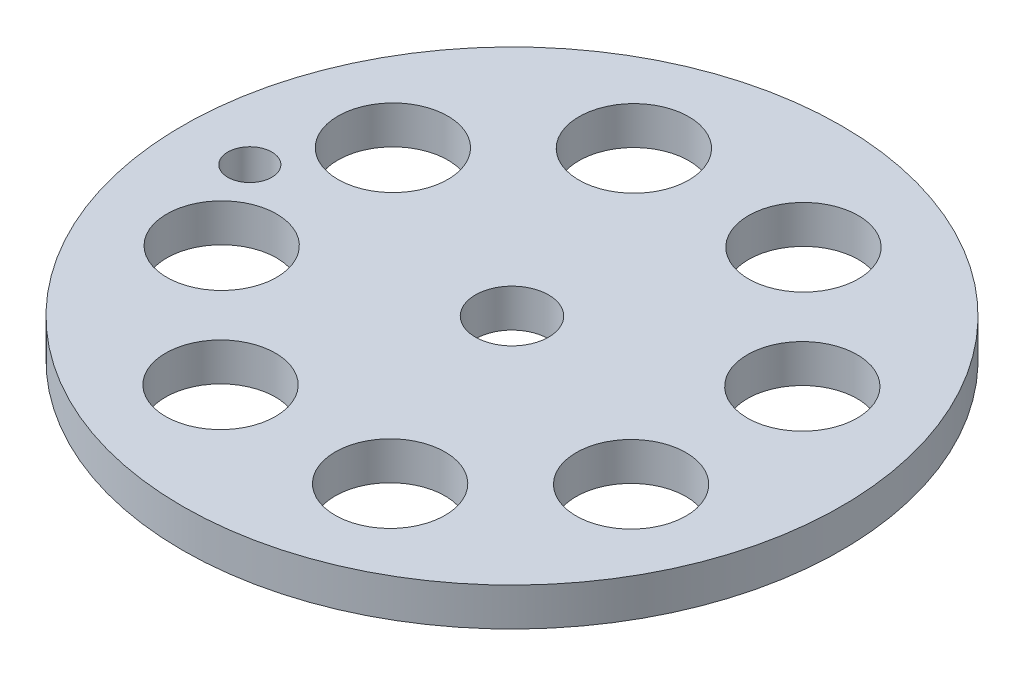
ISO-10303-21;
HEADER;
FILE_DESCRIPTION(('STEP AP214'),'2;1');
FILE_NAME('part.step','',(''),(''),'','','');
FILE_SCHEMA(('AUTOMOTIVE_DESIGN { 1 0 10303 214 1 1 1 1 }'));
ENDSEC;
DATA;
#1=APPLICATION_CONTEXT('core data for automotive mechanical design processes');
#2=APPLICATION_PROTOCOL_DEFINITION('international standard','automotive_design',2000,#1);
#3=PRODUCT_CONTEXT('',#1,'mechanical');
#4=PRODUCT('Part','Part','',(#3));
#5=PRODUCT_RELATED_PRODUCT_CATEGORY('part','',(#4));
#6=PRODUCT_DEFINITION_FORMATION('','',#4);
#7=PRODUCT_DEFINITION_CONTEXT('part definition',#1,'design');
#8=PRODUCT_DEFINITION('design','',#6,#7);
#9=PRODUCT_DEFINITION_SHAPE('','',#8);
#10=(LENGTH_UNIT() NAMED_UNIT(*) SI_UNIT(.MILLI.,.METRE.));
#11=(NAMED_UNIT(*) PLANE_ANGLE_UNIT() SI_UNIT($,.RADIAN.));
#12=(NAMED_UNIT(*) SI_UNIT($,.STERADIAN.) SOLID_ANGLE_UNIT());
#13=UNCERTAINTY_MEASURE_WITH_UNIT(LENGTH_MEASURE(1.E-05),#10,'distance_accuracy_value','');
#14=(GEOMETRIC_REPRESENTATION_CONTEXT(3) GLOBAL_UNCERTAINTY_ASSIGNED_CONTEXT((#13)) GLOBAL_UNIT_ASSIGNED_CONTEXT((#10,
#11,#12)) REPRESENTATION_CONTEXT('',''));
#15=CARTESIAN_POINT('',(0.,0.,0.));
#16=DIRECTION('',(0.,0.,1.));
#17=DIRECTION('',(1.,0.,0.));
#18=AXIS2_PLACEMENT_3D('',#15,#16,#17);
#19=CARTESIAN_POINT('',(0.,1.651,0.));
#20=DIRECTION('',(0.,1.,0.));
#21=DIRECTION('',(0.,0.,1.));
#22=AXIS2_PLACEMENT_3D('',#19,#20,#21);
#23=PLANE('',#22);
#24=CARTESIAN_POINT('',(-22.733,1.651,0.));
#25=DIRECTION('',(0.,1.,0.));
#26=DIRECTION('',(0.,0.,1.));
#27=AXIS2_PLACEMENT_3D('',#24,#25,#26);
#28=CIRCLE('',#27,1.905);
#29=CARTESIAN_POINT('',(-22.733,1.651,1.905));
#30=VERTEX_POINT('',#29);
#31=EDGE_CURVE('E100',#30,#30,#28,.T.);
#32=ORIENTED_EDGE('',*,*,#31,.F.);
#33=EDGE_LOOP('',(#32));
#34=FACE_BOUND('',#33,.T.);
#35=CARTESIAN_POINT('',(7.47197518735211,1.651,-17.7992697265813));
#36=DIRECTION('',(0.,1.,0.));
#37=DIRECTION('',(0.707106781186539,0.,0.707106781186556));
#38=AXIS2_PLACEMENT_3D('',#35,#36,#37);
#39=CIRCLE('',#38,4.7625);
#40=CARTESIAN_POINT('',(10.839571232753,1.651,-14.4316736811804));
#41=VERTEX_POINT('',#40);
#42=EDGE_CURVE('E91',#41,#41,#39,.T.);
#43=ORIENTED_EDGE('',*,*,#42,.F.);
#44=EDGE_LOOP('',(#43));
#45=FACE_BOUND('',#44,.T.);
#46=CARTESIAN_POINT('',(-7.30249999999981,1.651,-17.8694686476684));
#47=DIRECTION('',(0.,1.,0.));
#48=DIRECTION('',(1.,0.,0.));
#49=AXIS2_PLACEMENT_3D('',#46,#47,#48);
#50=CIRCLE('',#49,4.7625);
#51=CARTESIAN_POINT('',(-2.53999999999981,1.651,-17.8694686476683));
#52=VERTEX_POINT('',#51);
#53=EDGE_CURVE('E85',#52,#52,#50,.T.);
#54=ORIENTED_EDGE('',*,*,#53,.F.);
#55=EDGE_LOOP('',(#54));
#56=FACE_BOUND('',#55,.T.);
#57=CARTESIAN_POINT('',(-17.7992697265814,1.651,-7.47197518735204));
#58=DIRECTION('',(0.,1.,0.));
#59=DIRECTION('',(0.707106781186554,0.,-0.707106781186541));
#60=AXIS2_PLACEMENT_3D('',#57,#58,#59);
#61=CIRCLE('',#60,4.7625);
#62=CARTESIAN_POINT('',(-14.4316736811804,1.651,-10.8395712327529));
#63=VERTEX_POINT('',#62);
#64=EDGE_CURVE('E79',#63,#63,#61,.T.);
#65=ORIENTED_EDGE('',*,*,#64,.F.);
#66=EDGE_LOOP('',(#65));
#67=FACE_BOUND('',#66,.T.);
#68=CARTESIAN_POINT('',(-17.8694686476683,1.651,7.30249999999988));
#69=DIRECTION('',(0.,1.,0.));
#70=DIRECTION('',(0.,0.,-1.));
#71=AXIS2_PLACEMENT_3D('',#68,#69,#70);
#72=CIRCLE('',#71,4.7625);
#73=CARTESIAN_POINT('',(-17.8694686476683,1.651,2.53999999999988));
#74=VERTEX_POINT('',#73);
#75=EDGE_CURVE('E73',#74,#74,#72,.T.);
#76=ORIENTED_EDGE('',*,*,#75,.F.);
#77=EDGE_LOOP('',(#76));
#78=FACE_BOUND('',#77,.T.);
#79=CARTESIAN_POINT('',(-7.47197518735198,1.651,17.7992697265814));
#80=DIRECTION('',(0.,1.,0.));
#81=DIRECTION('',(-0.707106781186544,0.,-0.707106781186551));
#82=AXIS2_PLACEMENT_3D('',#79,#80,#81);
#83=CIRCLE('',#82,4.7625);
#84=CARTESIAN_POINT('',(-10.8395712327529,1.651,14.4316736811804));
#85=VERTEX_POINT('',#84);
#86=EDGE_CURVE('E67',#85,#85,#83,.T.);
#87=ORIENTED_EDGE('',*,*,#86,.F.);
#88=EDGE_LOOP('',(#87));
#89=FACE_BOUND('',#88,.T.);
#90=CARTESIAN_POINT('',(7.30249999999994,1.651,17.8694686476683));
#91=DIRECTION('',(0.,1.,0.));
#92=DIRECTION('',(-1.,0.,0.));
#93=AXIS2_PLACEMENT_3D('',#90,#91,#92);
#94=CIRCLE('',#93,4.7625);
#95=CARTESIAN_POINT('',(2.53999999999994,1.651,17.8694686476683));
#96=VERTEX_POINT('',#95);
#97=EDGE_CURVE('E61',#96,#96,#94,.T.);
#98=ORIENTED_EDGE('',*,*,#97,.F.);
#99=EDGE_LOOP('',(#98));
#100=FACE_BOUND('',#99,.T.);
#101=CARTESIAN_POINT('',(17.7992697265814,1.651,7.47197518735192));
#102=DIRECTION('',(0.,1.,0.));
#103=DIRECTION('',(-0.707106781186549,0.,0.707106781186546));
#104=AXIS2_PLACEMENT_3D('',#101,#102,#103);
#105=CIRCLE('',#104,4.7625);
#106=CARTESIAN_POINT('',(14.4316736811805,1.651,10.8395712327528));
#107=VERTEX_POINT('',#106);
#108=EDGE_CURVE('E55',#107,#107,#105,.T.);
#109=ORIENTED_EDGE('',*,*,#108,.F.);
#110=EDGE_LOOP('',(#109));
#111=FACE_BOUND('',#110,.T.);
#112=CARTESIAN_POINT('',(17.8694686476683,1.651,-7.3025));
#113=DIRECTION('',(0.,1.,0.));
#114=DIRECTION('',(0.,0.,1.));
#115=AXIS2_PLACEMENT_3D('',#112,#113,#114);
#116=CIRCLE('',#115,4.7625);
#117=CARTESIAN_POINT('',(17.8694686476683,1.651,-2.54));
#118=VERTEX_POINT('',#117);
#119=EDGE_CURVE('E52',#118,#118,#116,.T.);
#120=ORIENTED_EDGE('',*,*,#119,.F.);
#121=EDGE_LOOP('',(#120));
#122=FACE_BOUND('',#121,.T.);
#123=CARTESIAN_POINT('',(0.,1.651,0.));
#124=DIRECTION('',(0.,1.,0.));
#125=DIRECTION('',(0.,0.,1.));
#126=AXIS2_PLACEMENT_3D('',#123,#124,#125);
#127=CIRCLE('',#126,28.575);
#128=CARTESIAN_POINT('',(0.,1.651,-28.575));
#129=VERTEX_POINT('',#128);
#130=EDGE_CURVE('E10',#129,#129,#127,.T.);
#131=ORIENTED_EDGE('',*,*,#130,.T.);
#132=EDGE_LOOP('',(#131));
#133=FACE_BOUND('',#132,.T.);
#134=CARTESIAN_POINT('',(0.,1.651,0.));
#135=DIRECTION('',(0.,1.,0.));
#136=DIRECTION('',(0.,0.,1.));
#137=AXIS2_PLACEMENT_3D('',#134,#135,#136);
#138=CIRCLE('',#137,3.175);
#139=CARTESIAN_POINT('',(0.,1.651,-3.175));
#140=VERTEX_POINT('',#139);
#141=EDGE_CURVE('E40',#140,#140,#138,.T.);
#142=ORIENTED_EDGE('',*,*,#141,.F.);
#143=EDGE_LOOP('',(#142));
#144=FACE_BOUND('',#143,.T.);
#145=ADVANCED_FACE('F29',(#34,#45,#56,#67,#78,#89,#100,#111,#122,#133,#144),#23,.T.);
#146=CARTESIAN_POINT('',(0.,-1.651,0.));
#147=DIRECTION('',(0.,1.,0.));
#148=DIRECTION('',(0.,0.,1.));
#149=AXIS2_PLACEMENT_3D('',#146,#147,#148);
#150=PLANE('',#149);
#151=CARTESIAN_POINT('',(-22.733,-1.651,0.));
#152=DIRECTION('',(0.,1.,0.));
#153=DIRECTION('',(0.,0.,1.));
#154=AXIS2_PLACEMENT_3D('',#151,#152,#153);
#155=CIRCLE('',#154,1.905);
#156=CARTESIAN_POINT('',(-22.733,-1.651,1.905));
#157=VERTEX_POINT('',#156);
#158=EDGE_CURVE('E97',#157,#157,#155,.T.);
#159=ORIENTED_EDGE('',*,*,#158,.T.);
#160=EDGE_LOOP('',(#159));
#161=FACE_BOUND('',#160,.T.);
#162=CARTESIAN_POINT('',(7.47197518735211,-1.651,-17.7992697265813));
#163=DIRECTION('',(0.,1.,0.));
#164=DIRECTION('',(0.707106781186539,0.,0.707106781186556));
#165=AXIS2_PLACEMENT_3D('',#162,#163,#164);
#166=CIRCLE('',#165,4.7625);
#167=CARTESIAN_POINT('',(10.839571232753,-1.651,-14.4316736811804));
#168=VERTEX_POINT('',#167);
#169=EDGE_CURVE('E94',#168,#168,#166,.T.);
#170=ORIENTED_EDGE('',*,*,#169,.T.);
#171=EDGE_LOOP('',(#170));
#172=FACE_BOUND('',#171,.T.);
#173=CARTESIAN_POINT('',(-7.30249999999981,-1.651,-17.8694686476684));
#174=DIRECTION('',(0.,1.,0.));
#175=DIRECTION('',(1.,0.,0.));
#176=AXIS2_PLACEMENT_3D('',#173,#174,#175);
#177=CIRCLE('',#176,4.7625);
#178=CARTESIAN_POINT('',(-2.53999999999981,-1.651,-17.8694686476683));
#179=VERTEX_POINT('',#178);
#180=EDGE_CURVE('E88',#179,#179,#177,.T.);
#181=ORIENTED_EDGE('',*,*,#180,.T.);
#182=EDGE_LOOP('',(#181));
#183=FACE_BOUND('',#182,.T.);
#184=CARTESIAN_POINT('',(-17.7992697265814,-1.651,-7.47197518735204));
#185=DIRECTION('',(0.,1.,0.));
#186=DIRECTION('',(0.707106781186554,0.,-0.707106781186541));
#187=AXIS2_PLACEMENT_3D('',#184,#185,#186);
#188=CIRCLE('',#187,4.7625);
#189=CARTESIAN_POINT('',(-14.4316736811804,-1.651,-10.8395712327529));
#190=VERTEX_POINT('',#189);
#191=EDGE_CURVE('E82',#190,#190,#188,.T.);
#192=ORIENTED_EDGE('',*,*,#191,.T.);
#193=EDGE_LOOP('',(#192));
#194=FACE_BOUND('',#193,.T.);
#195=CARTESIAN_POINT('',(-17.8694686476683,-1.651,7.30249999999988));
#196=DIRECTION('',(0.,1.,0.));
#197=DIRECTION('',(0.,0.,-1.));
#198=AXIS2_PLACEMENT_3D('',#195,#196,#197);
#199=CIRCLE('',#198,4.7625);
#200=CARTESIAN_POINT('',(-17.8694686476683,-1.651,2.53999999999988));
#201=VERTEX_POINT('',#200);
#202=EDGE_CURVE('E76',#201,#201,#199,.T.);
#203=ORIENTED_EDGE('',*,*,#202,.T.);
#204=EDGE_LOOP('',(#203));
#205=FACE_BOUND('',#204,.T.);
#206=CARTESIAN_POINT('',(-7.47197518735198,-1.651,17.7992697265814));
#207=DIRECTION('',(0.,1.,0.));
#208=DIRECTION('',(-0.707106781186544,0.,-0.707106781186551));
#209=AXIS2_PLACEMENT_3D('',#206,#207,#208);
#210=CIRCLE('',#209,4.7625);
#211=CARTESIAN_POINT('',(-10.8395712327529,-1.651,14.4316736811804));
#212=VERTEX_POINT('',#211);
#213=EDGE_CURVE('E70',#212,#212,#210,.T.);
#214=ORIENTED_EDGE('',*,*,#213,.T.);
#215=EDGE_LOOP('',(#214));
#216=FACE_BOUND('',#215,.T.);
#217=CARTESIAN_POINT('',(7.30249999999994,-1.651,17.8694686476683));
#218=DIRECTION('',(0.,1.,0.));
#219=DIRECTION('',(-1.,0.,0.));
#220=AXIS2_PLACEMENT_3D('',#217,#218,#219);
#221=CIRCLE('',#220,4.7625);
#222=CARTESIAN_POINT('',(2.53999999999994,-1.651,17.8694686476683));
#223=VERTEX_POINT('',#222);
#224=EDGE_CURVE('E64',#223,#223,#221,.T.);
#225=ORIENTED_EDGE('',*,*,#224,.T.);
#226=EDGE_LOOP('',(#225));
#227=FACE_BOUND('',#226,.T.);
#228=CARTESIAN_POINT('',(17.7992697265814,-1.651,7.47197518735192));
#229=DIRECTION('',(0.,1.,0.));
#230=DIRECTION('',(-0.707106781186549,0.,0.707106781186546));
#231=AXIS2_PLACEMENT_3D('',#228,#229,#230);
#232=CIRCLE('',#231,4.7625);
#233=CARTESIAN_POINT('',(14.4316736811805,-1.651,10.8395712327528));
#234=VERTEX_POINT('',#233);
#235=EDGE_CURVE('E58',#234,#234,#232,.T.);
#236=ORIENTED_EDGE('',*,*,#235,.T.);
#237=EDGE_LOOP('',(#236));
#238=FACE_BOUND('',#237,.T.);
#239=CARTESIAN_POINT('',(17.8694686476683,-1.651,-7.3025));
#240=DIRECTION('',(0.,1.,0.));
#241=DIRECTION('',(0.,0.,1.));
#242=AXIS2_PLACEMENT_3D('',#239,#240,#241);
#243=CIRCLE('',#242,4.7625);
#244=CARTESIAN_POINT('',(17.8694686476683,-1.651,-2.54));
#245=VERTEX_POINT('',#244);
#246=EDGE_CURVE('E49',#245,#245,#243,.T.);
#247=ORIENTED_EDGE('',*,*,#246,.T.);
#248=EDGE_LOOP('',(#247));
#249=FACE_BOUND('',#248,.T.);
#250=CARTESIAN_POINT('',(0.,-1.651,0.));
#251=DIRECTION('',(0.,1.,0.));
#252=DIRECTION('',(0.,0.,1.));
#253=AXIS2_PLACEMENT_3D('',#250,#251,#252);
#254=CIRCLE('',#253,28.575);
#255=CARTESIAN_POINT('',(0.,-1.651,-28.575));
#256=VERTEX_POINT('',#255);
#257=EDGE_CURVE('E36',#256,#256,#254,.T.);
#258=ORIENTED_EDGE('',*,*,#257,.F.);
#259=EDGE_LOOP('',(#258));
#260=FACE_BOUND('',#259,.T.);
#261=CARTESIAN_POINT('',(0.,-1.651,0.));
#262=DIRECTION('',(0.,1.,0.));
#263=DIRECTION('',(0.,0.,1.));
#264=AXIS2_PLACEMENT_3D('',#261,#262,#263);
#265=CIRCLE('',#264,3.175);
#266=CARTESIAN_POINT('',(0.,-1.651,-3.175));
#267=VERTEX_POINT('',#266);
#268=EDGE_CURVE('E44',#267,#267,#265,.T.);
#269=ORIENTED_EDGE('',*,*,#268,.T.);
#270=EDGE_LOOP('',(#269));
#271=FACE_BOUND('',#270,.T.);
#272=ADVANCED_FACE('F108',(#161,#172,#183,#194,#205,#216,#227,#238,#249,#260,#271),#150,.F.);
#273=CARTESIAN_POINT('',(0.,1.651,0.));
#274=DIRECTION('',(0.,-1.,0.));
#275=DIRECTION('',(0.,0.,-1.));
#276=AXIS2_PLACEMENT_3D('',#273,#274,#275);
#277=CYLINDRICAL_SURFACE('',#276,28.575);
#278=CARTESIAN_POINT('',(0.,1.651,-28.575));
#279=CARTESIAN_POINT('',(0.,1.61660416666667,-28.575));
#280=CARTESIAN_POINT('',(0.,1.58220833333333,-28.575));
#281=CARTESIAN_POINT('',(0.,1.51341666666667,-28.575));
#282=CARTESIAN_POINT('',(0.,1.47902083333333,-28.575));
#283=CARTESIAN_POINT('',(0.,1.41022916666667,-28.575));
#284=CARTESIAN_POINT('',(0.,1.37583333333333,-28.575));
#285=CARTESIAN_POINT('',(0.,1.30704166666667,-28.575));
#286=CARTESIAN_POINT('',(0.,1.27264583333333,-28.575));
#287=CARTESIAN_POINT('',(0.,1.20385416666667,-28.575));
#288=CARTESIAN_POINT('',(0.,1.16945833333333,-28.575));
#289=CARTESIAN_POINT('',(0.,1.10066666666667,-28.575));
#290=CARTESIAN_POINT('',(0.,1.06627083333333,-28.575));
#291=CARTESIAN_POINT('',(0.,0.997479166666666,-28.575));
#292=CARTESIAN_POINT('',(0.,0.963083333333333,-28.575));
#293=CARTESIAN_POINT('',(0.,0.894291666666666,-28.575));
#294=CARTESIAN_POINT('',(0.,0.859895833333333,-28.575));
#295=CARTESIAN_POINT('',(0.,0.791104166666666,-28.575));
#296=CARTESIAN_POINT('',(0.,0.756708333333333,-28.575));
#297=CARTESIAN_POINT('',(0.,0.687916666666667,-28.575));
#298=CARTESIAN_POINT('',(0.,0.653520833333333,-28.575));
#299=CARTESIAN_POINT('',(0.,0.584729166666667,-28.575));
#300=CARTESIAN_POINT('',(0.,0.550333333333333,-28.575));
#301=CARTESIAN_POINT('',(0.,0.481541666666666,-28.575));
#302=CARTESIAN_POINT('',(0.,0.447145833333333,-28.575));
#303=CARTESIAN_POINT('',(0.,0.378354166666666,-28.575));
#304=CARTESIAN_POINT('',(0.,0.343958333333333,-28.575));
#305=CARTESIAN_POINT('',(0.,0.275166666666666,-28.575));
#306=CARTESIAN_POINT('',(0.,0.240770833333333,-28.575));
#307=CARTESIAN_POINT('',(0.,0.171979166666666,-28.575));
#308=CARTESIAN_POINT('',(0.,0.137583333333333,-28.575));
#309=CARTESIAN_POINT('',(0.,0.0687916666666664,-28.575));
#310=CARTESIAN_POINT('',(0.,0.0343958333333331,-28.575));
#311=CARTESIAN_POINT('',(0.,-0.0343958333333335,-28.575));
#312=CARTESIAN_POINT('',(0.,-0.0687916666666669,-28.575));
#313=CARTESIAN_POINT('',(0.,-0.137583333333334,-28.575));
#314=CARTESIAN_POINT('',(0.,-0.171979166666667,-28.575));
#315=CARTESIAN_POINT('',(0.,-0.240770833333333,-28.575));
#316=CARTESIAN_POINT('',(0.,-0.275166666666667,-28.575));
#317=CARTESIAN_POINT('',(0.,-0.343958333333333,-28.575));
#318=CARTESIAN_POINT('',(0.,-0.378354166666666,-28.575));
#319=CARTESIAN_POINT('',(0.,-0.447145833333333,-28.575));
#320=CARTESIAN_POINT('',(0.,-0.481541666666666,-28.575));
#321=CARTESIAN_POINT('',(0.,-0.550333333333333,-28.575));
#322=CARTESIAN_POINT('',(0.,-0.584729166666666,-28.575));
#323=CARTESIAN_POINT('',(0.,-0.653520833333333,-28.575));
#324=CARTESIAN_POINT('',(0.,-0.687916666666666,-28.575));
#325=CARTESIAN_POINT('',(0.,-0.756708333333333,-28.575));
#326=CARTESIAN_POINT('',(0.,-0.791104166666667,-28.575));
#327=CARTESIAN_POINT('',(0.,-0.859895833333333,-28.575));
#328=CARTESIAN_POINT('',(0.,-0.894291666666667,-28.575));
#329=CARTESIAN_POINT('',(0.,-0.963083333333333,-28.575));
#330=CARTESIAN_POINT('',(0.,-0.997479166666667,-28.575));
#331=CARTESIAN_POINT('',(0.,-1.06627083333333,-28.575));
#332=CARTESIAN_POINT('',(0.,-1.10066666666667,-28.575));
#333=CARTESIAN_POINT('',(0.,-1.16945833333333,-28.575));
#334=CARTESIAN_POINT('',(0.,-1.20385416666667,-28.575));
#335=CARTESIAN_POINT('',(0.,-1.27264583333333,-28.575));
#336=CARTESIAN_POINT('',(0.,-1.30704166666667,-28.575));
#337=CARTESIAN_POINT('',(0.,-1.37583333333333,-28.575));
#338=CARTESIAN_POINT('',(0.,-1.41022916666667,-28.575));
#339=CARTESIAN_POINT('',(0.,-1.47902083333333,-28.575));
#340=CARTESIAN_POINT('',(0.,-1.51341666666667,-28.575));
#341=CARTESIAN_POINT('',(0.,-1.58220833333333,-28.575));
#342=CARTESIAN_POINT('',(0.,-1.61660416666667,-28.575));
#343=CARTESIAN_POINT('',(0.,-1.651,-28.575));
#344=B_SPLINE_CURVE_WITH_KNOTS('',3,(#278,#279,#280,#281,#282,#283,#284,#285,#286,#287,#288,
#289,#290,#291,#292,#293,#294,#295,#296,#297,#298,#299,#300,#301,#302,#303,#304,#305,#306,#307,
#308,#309,#310,#311,#312,#313,#314,#315,#316,#317,#318,#319,#320,#321,#322,#323,#324,#325,#326,
#327,#328,#329,#330,#331,#332,#333,#334,#335,#336,#337,#338,#339,#340,#341,#342,#343),
.UNSPECIFIED.,.F.,.F.,(4,2,2,2,2,2,2,2,2,2,2,2,2,2,2,2,2,2,2,2,2,2,2,2,2,2,2,2,2,2,2,2,4),(0.,
0.1031875,0.206375,0.3095625,0.41275,0.5159375,0.619125,0.7223125,0.8255,0.9286875,1.031875,
1.1350625,1.23825,1.3414375,1.444625,1.5478125,1.651,1.7541875,1.857375,1.9605625,2.06375,
2.1669375,2.270125,2.3733125,2.4765,2.5796875,2.682875,2.7860625,2.88925,2.9924375,3.095625,
3.1988125,3.302),.UNSPECIFIED.);
#345=EDGE_CURVE('BSEAM31',#129,#256,#344,.T.);
#346=ORIENTED_EDGE('',*,*,#130,.F.);
#347=ORIENTED_EDGE('',*,*,#257,.T.);
#348=ORIENTED_EDGE('',*,*,#345,.T.);
#349=ORIENTED_EDGE('',*,*,#345,.F.);
#350=EDGE_LOOP('',(#346,#348,#347,#349));
#351=FACE_BOUND('',#350,.T.);
#352=ADVANCED_FACE('F31',(#351),#277,.T.);
#353=CARTESIAN_POINT('',(0.,1.651,0.));
#354=DIRECTION('',(0.,-1.,0.));
#355=DIRECTION('',(0.,0.,-1.));
#356=AXIS2_PLACEMENT_3D('',#353,#354,#355);
#357=CYLINDRICAL_SURFACE('',#356,3.175);
#358=CARTESIAN_POINT('',(0.,1.651,-3.175));
#359=CARTESIAN_POINT('',(0.,1.61660416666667,-3.175));
#360=CARTESIAN_POINT('',(0.,1.58220833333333,-3.175));
#361=CARTESIAN_POINT('',(0.,1.51341666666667,-3.175));
#362=CARTESIAN_POINT('',(0.,1.47902083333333,-3.175));
#363=CARTESIAN_POINT('',(0.,1.41022916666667,-3.175));
#364=CARTESIAN_POINT('',(0.,1.37583333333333,-3.175));
#365=CARTESIAN_POINT('',(0.,1.30704166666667,-3.175));
#366=CARTESIAN_POINT('',(0.,1.27264583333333,-3.175));
#367=CARTESIAN_POINT('',(0.,1.20385416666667,-3.175));
#368=CARTESIAN_POINT('',(0.,1.16945833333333,-3.175));
#369=CARTESIAN_POINT('',(0.,1.10066666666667,-3.175));
#370=CARTESIAN_POINT('',(0.,1.06627083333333,-3.175));
#371=CARTESIAN_POINT('',(0.,0.997479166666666,-3.175));
#372=CARTESIAN_POINT('',(0.,0.963083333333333,-3.175));
#373=CARTESIAN_POINT('',(0.,0.894291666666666,-3.175));
#374=CARTESIAN_POINT('',(0.,0.859895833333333,-3.175));
#375=CARTESIAN_POINT('',(0.,0.791104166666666,-3.175));
#376=CARTESIAN_POINT('',(0.,0.756708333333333,-3.175));
#377=CARTESIAN_POINT('',(0.,0.687916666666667,-3.175));
#378=CARTESIAN_POINT('',(0.,0.653520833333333,-3.175));
#379=CARTESIAN_POINT('',(0.,0.584729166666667,-3.175));
#380=CARTESIAN_POINT('',(0.,0.550333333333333,-3.175));
#381=CARTESIAN_POINT('',(0.,0.481541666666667,-3.175));
#382=CARTESIAN_POINT('',(0.,0.447145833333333,-3.175));
#383=CARTESIAN_POINT('',(0.,0.378354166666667,-3.175));
#384=CARTESIAN_POINT('',(0.,0.343958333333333,-3.175));
#385=CARTESIAN_POINT('',(0.,0.275166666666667,-3.175));
#386=CARTESIAN_POINT('',(0.,0.240770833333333,-3.175));
#387=CARTESIAN_POINT('',(0.,0.171979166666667,-3.175));
#388=CARTESIAN_POINT('',(0.,0.137583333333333,-3.175));
#389=CARTESIAN_POINT('',(0.,0.0687916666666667,-3.175));
#390=CARTESIAN_POINT('',(0.,0.0343958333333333,-3.175));
#391=CARTESIAN_POINT('',(0.,-0.0343958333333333,-3.175));
#392=CARTESIAN_POINT('',(0.,-0.0687916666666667,-3.175));
#393=CARTESIAN_POINT('',(0.,-0.137583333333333,-3.175));
#394=CARTESIAN_POINT('',(0.,-0.171979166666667,-3.175));
#395=CARTESIAN_POINT('',(0.,-0.240770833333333,-3.175));
#396=CARTESIAN_POINT('',(0.,-0.275166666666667,-3.175));
#397=CARTESIAN_POINT('',(0.,-0.343958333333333,-3.175));
#398=CARTESIAN_POINT('',(0.,-0.378354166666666,-3.175));
#399=CARTESIAN_POINT('',(0.,-0.447145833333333,-3.175));
#400=CARTESIAN_POINT('',(0.,-0.481541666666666,-3.175));
#401=CARTESIAN_POINT('',(0.,-0.550333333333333,-3.175));
#402=CARTESIAN_POINT('',(0.,-0.584729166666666,-3.175));
#403=CARTESIAN_POINT('',(0.,-0.653520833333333,-3.175));
#404=CARTESIAN_POINT('',(0.,-0.687916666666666,-3.175));
#405=CARTESIAN_POINT('',(0.,-0.756708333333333,-3.175));
#406=CARTESIAN_POINT('',(0.,-0.791104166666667,-3.175));
#407=CARTESIAN_POINT('',(0.,-0.859895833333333,-3.175));
#408=CARTESIAN_POINT('',(0.,-0.894291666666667,-3.175));
#409=CARTESIAN_POINT('',(0.,-0.963083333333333,-3.175));
#410=CARTESIAN_POINT('',(0.,-0.997479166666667,-3.175));
#411=CARTESIAN_POINT('',(0.,-1.06627083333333,-3.175));
#412=CARTESIAN_POINT('',(0.,-1.10066666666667,-3.175));
#413=CARTESIAN_POINT('',(0.,-1.16945833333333,-3.175));
#414=CARTESIAN_POINT('',(0.,-1.20385416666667,-3.175));
#415=CARTESIAN_POINT('',(0.,-1.27264583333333,-3.175));
#416=CARTESIAN_POINT('',(0.,-1.30704166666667,-3.175));
#417=CARTESIAN_POINT('',(0.,-1.37583333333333,-3.175));
#418=CARTESIAN_POINT('',(0.,-1.41022916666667,-3.175));
#419=CARTESIAN_POINT('',(0.,-1.47902083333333,-3.175));
#420=CARTESIAN_POINT('',(0.,-1.51341666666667,-3.175));
#421=CARTESIAN_POINT('',(0.,-1.58220833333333,-3.175));
#422=CARTESIAN_POINT('',(0.,-1.61660416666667,-3.175));
#423=CARTESIAN_POINT('',(0.,-1.651,-3.175));
#424=B_SPLINE_CURVE_WITH_KNOTS('',3,(#358,#359,#360,#361,#362,#363,#364,#365,#366,#367,#368,
#369,#370,#371,#372,#373,#374,#375,#376,#377,#378,#379,#380,#381,#382,#383,#384,#385,#386,#387,
#388,#389,#390,#391,#392,#393,#394,#395,#396,#397,#398,#399,#400,#401,#402,#403,#404,#405,#406,
#407,#408,#409,#410,#411,#412,#413,#414,#415,#416,#417,#418,#419,#420,#421,#422,#423),
.UNSPECIFIED.,.F.,.F.,(4,2,2,2,2,2,2,2,2,2,2,2,2,2,2,2,2,2,2,2,2,2,2,2,2,2,2,2,2,2,2,2,4),(0.,
0.1031875,0.206375,0.3095625,0.41275,0.5159375,0.619125,0.7223125,0.8255,0.9286875,1.031875,
1.1350625,1.23825,1.3414375,1.444625,1.5478125,1.651,1.7541875,1.857375,1.9605625,2.06375,
2.1669375,2.270125,2.3733125,2.4765,2.5796875,2.682875,2.7860625,2.88925,2.9924375,3.095625,
3.1988125,3.302),.UNSPECIFIED.);
#425=EDGE_CURVE('BSEAM127',#140,#267,#424,.T.);
#426=ORIENTED_EDGE('',*,*,#141,.T.);
#427=ORIENTED_EDGE('',*,*,#268,.F.);
#428=ORIENTED_EDGE('',*,*,#425,.T.);
#429=ORIENTED_EDGE('',*,*,#425,.F.);
#430=EDGE_LOOP('',(#426,#428,#427,#429));
#431=FACE_BOUND('',#430,.T.);
#432=ADVANCED_FACE('F127',(#431),#357,.F.);
#433=CARTESIAN_POINT('',(17.8694686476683,-1.651,-7.3025));
#434=DIRECTION('',(0.,1.,0.));
#435=DIRECTION('',(0.,0.,1.));
#436=AXIS2_PLACEMENT_3D('',#433,#434,#435);
#437=CYLINDRICAL_SURFACE('',#436,4.7625);
#438=CARTESIAN_POINT('',(17.8694686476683,-1.651,-2.54));
#439=CARTESIAN_POINT('',(17.8694686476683,-1.61660416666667,-2.54));
#440=CARTESIAN_POINT('',(17.8694686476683,-1.58220833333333,-2.54));
#441=CARTESIAN_POINT('',(17.8694686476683,-1.51341666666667,-2.54));
#442=CARTESIAN_POINT('',(17.8694686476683,-1.47902083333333,-2.54));
#443=CARTESIAN_POINT('',(17.8694686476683,-1.41022916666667,-2.54));
#444=CARTESIAN_POINT('',(17.8694686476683,-1.37583333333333,-2.54));
#445=CARTESIAN_POINT('',(17.8694686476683,-1.30704166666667,-2.54));
#446=CARTESIAN_POINT('',(17.8694686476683,-1.27264583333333,-2.54));
#447=CARTESIAN_POINT('',(17.8694686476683,-1.20385416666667,-2.54));
#448=CARTESIAN_POINT('',(17.8694686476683,-1.16945833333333,-2.54));
#449=CARTESIAN_POINT('',(17.8694686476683,-1.10066666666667,-2.54));
#450=CARTESIAN_POINT('',(17.8694686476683,-1.06627083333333,-2.54));
#451=CARTESIAN_POINT('',(17.8694686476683,-0.997479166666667,-2.54));
#452=CARTESIAN_POINT('',(17.8694686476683,-0.963083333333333,-2.54));
#453=CARTESIAN_POINT('',(17.8694686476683,-0.894291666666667,-2.54));
#454=CARTESIAN_POINT('',(17.8694686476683,-0.859895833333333,-2.54));
#455=CARTESIAN_POINT('',(17.8694686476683,-0.791104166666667,-2.54));
#456=CARTESIAN_POINT('',(17.8694686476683,-0.756708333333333,-2.54));
#457=CARTESIAN_POINT('',(17.8694686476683,-0.687916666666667,-2.54));
#458=CARTESIAN_POINT('',(17.8694686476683,-0.653520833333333,-2.54));
#459=CARTESIAN_POINT('',(17.8694686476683,-0.584729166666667,-2.54));
#460=CARTESIAN_POINT('',(17.8694686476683,-0.550333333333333,-2.54));
#461=CARTESIAN_POINT('',(17.8694686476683,-0.481541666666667,-2.54));
#462=CARTESIAN_POINT('',(17.8694686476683,-0.447145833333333,-2.54));
#463=CARTESIAN_POINT('',(17.8694686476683,-0.378354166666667,-2.54));
#464=CARTESIAN_POINT('',(17.8694686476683,-0.343958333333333,-2.54));
#465=CARTESIAN_POINT('',(17.8694686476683,-0.275166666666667,-2.54));
#466=CARTESIAN_POINT('',(17.8694686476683,-0.240770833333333,-2.54));
#467=CARTESIAN_POINT('',(17.8694686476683,-0.171979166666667,-2.54));
#468=CARTESIAN_POINT('',(17.8694686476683,-0.137583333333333,-2.54));
#469=CARTESIAN_POINT('',(17.8694686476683,-0.0687916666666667,-2.54));
#470=CARTESIAN_POINT('',(17.8694686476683,-0.0343958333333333,-2.54));
#471=CARTESIAN_POINT('',(17.8694686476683,0.0343958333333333,-2.54));
#472=CARTESIAN_POINT('',(17.8694686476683,0.0687916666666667,-2.54));
#473=CARTESIAN_POINT('',(17.8694686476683,0.137583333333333,-2.54));
#474=CARTESIAN_POINT('',(17.8694686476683,0.171979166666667,-2.54));
#475=CARTESIAN_POINT('',(17.8694686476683,0.240770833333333,-2.54));
#476=CARTESIAN_POINT('',(17.8694686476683,0.275166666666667,-2.54));
#477=CARTESIAN_POINT('',(17.8694686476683,0.343958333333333,-2.54));
#478=CARTESIAN_POINT('',(17.8694686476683,0.378354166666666,-2.54));
#479=CARTESIAN_POINT('',(17.8694686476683,0.447145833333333,-2.54));
#480=CARTESIAN_POINT('',(17.8694686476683,0.481541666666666,-2.54));
#481=CARTESIAN_POINT('',(17.8694686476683,0.550333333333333,-2.54));
#482=CARTESIAN_POINT('',(17.8694686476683,0.584729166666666,-2.54));
#483=CARTESIAN_POINT('',(17.8694686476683,0.653520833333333,-2.54));
#484=CARTESIAN_POINT('',(17.8694686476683,0.687916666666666,-2.54));
#485=CARTESIAN_POINT('',(17.8694686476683,0.756708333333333,-2.54));
#486=CARTESIAN_POINT('',(17.8694686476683,0.791104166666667,-2.54));
#487=CARTESIAN_POINT('',(17.8694686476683,0.859895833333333,-2.54));
#488=CARTESIAN_POINT('',(17.8694686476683,0.894291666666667,-2.54));
#489=CARTESIAN_POINT('',(17.8694686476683,0.963083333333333,-2.54));
#490=CARTESIAN_POINT('',(17.8694686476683,0.997479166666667,-2.54));
#491=CARTESIAN_POINT('',(17.8694686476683,1.06627083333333,-2.54));
#492=CARTESIAN_POINT('',(17.8694686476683,1.10066666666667,-2.54));
#493=CARTESIAN_POINT('',(17.8694686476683,1.16945833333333,-2.54));
#494=CARTESIAN_POINT('',(17.8694686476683,1.20385416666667,-2.54));
#495=CARTESIAN_POINT('',(17.8694686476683,1.27264583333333,-2.54));
#496=CARTESIAN_POINT('',(17.8694686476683,1.30704166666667,-2.54));
#497=CARTESIAN_POINT('',(17.8694686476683,1.37583333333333,-2.54));
#498=CARTESIAN_POINT('',(17.8694686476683,1.41022916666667,-2.54));
#499=CARTESIAN_POINT('',(17.8694686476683,1.47902083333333,-2.54));
#500=CARTESIAN_POINT('',(17.8694686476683,1.51341666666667,-2.54));
#501=CARTESIAN_POINT('',(17.8694686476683,1.58220833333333,-2.54));
#502=CARTESIAN_POINT('',(17.8694686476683,1.61660416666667,-2.54));
#503=CARTESIAN_POINT('',(17.8694686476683,1.651,-2.54));
#504=B_SPLINE_CURVE_WITH_KNOTS('',3,(#438,#439,#440,#441,#442,#443,#444,#445,#446,#447,#448,
#449,#450,#451,#452,#453,#454,#455,#456,#457,#458,#459,#460,#461,#462,#463,#464,#465,#466,#467,
#468,#469,#470,#471,#472,#473,#474,#475,#476,#477,#478,#479,#480,#481,#482,#483,#484,#485,#486,
#487,#488,#489,#490,#491,#492,#493,#494,#495,#496,#497,#498,#499,#500,#501,#502,#503),
.UNSPECIFIED.,.F.,.F.,(4,2,2,2,2,2,2,2,2,2,2,2,2,2,2,2,2,2,2,2,2,2,2,2,2,2,2,2,2,2,2,2,4),(0.,
0.1031875,0.206375,0.3095625,0.41275,0.5159375,0.619125,0.7223125,0.8255,0.9286875,1.031875,
1.1350625,1.23825,1.3414375,1.444625,1.5478125,1.651,1.7541875,1.857375,1.9605625,2.06375,
2.1669375,2.270125,2.3733125,2.4765,2.5796875,2.682875,2.7860625,2.88925,2.9924375,3.095625,
3.1988125,3.302),.UNSPECIFIED.);
#505=EDGE_CURVE('BSEAM130',#245,#118,#504,.T.);
#506=ORIENTED_EDGE('',*,*,#246,.F.);
#507=ORIENTED_EDGE('',*,*,#119,.T.);
#508=ORIENTED_EDGE('',*,*,#505,.T.);
#509=ORIENTED_EDGE('',*,*,#505,.F.);
#510=EDGE_LOOP('',(#506,#508,#507,#509));
#511=FACE_BOUND('',#510,.T.);
#512=ADVANCED_FACE('F130',(#511),#437,.F.);
#513=CARTESIAN_POINT('',(17.7992697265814,-1.651,7.47197518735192));
#514=DIRECTION('',(0.,1.,0.));
#515=DIRECTION('',(-0.707106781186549,0.,0.707106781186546));
#516=AXIS2_PLACEMENT_3D('',#513,#514,#515);
#517=CYLINDRICAL_SURFACE('',#516,4.7625);
#518=CARTESIAN_POINT('',(14.4316736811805,-1.651,10.8395712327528));
#519=CARTESIAN_POINT('',(14.4316736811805,-1.61660416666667,10.8395712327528));
#520=CARTESIAN_POINT('',(14.4316736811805,-1.58220833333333,10.8395712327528));
#521=CARTESIAN_POINT('',(14.4316736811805,-1.51341666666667,10.8395712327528));
#522=CARTESIAN_POINT('',(14.4316736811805,-1.47902083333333,10.8395712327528));
#523=CARTESIAN_POINT('',(14.4316736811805,-1.41022916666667,10.8395712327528));
#524=CARTESIAN_POINT('',(14.4316736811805,-1.37583333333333,10.8395712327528));
#525=CARTESIAN_POINT('',(14.4316736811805,-1.30704166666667,10.8395712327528));
#526=CARTESIAN_POINT('',(14.4316736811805,-1.27264583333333,10.8395712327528));
#527=CARTESIAN_POINT('',(14.4316736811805,-1.20385416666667,10.8395712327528));
#528=CARTESIAN_POINT('',(14.4316736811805,-1.16945833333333,10.8395712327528));
#529=CARTESIAN_POINT('',(14.4316736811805,-1.10066666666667,10.8395712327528));
#530=CARTESIAN_POINT('',(14.4316736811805,-1.06627083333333,10.8395712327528));
#531=CARTESIAN_POINT('',(14.4316736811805,-0.997479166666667,10.8395712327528));
#532=CARTESIAN_POINT('',(14.4316736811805,-0.963083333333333,10.8395712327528));
#533=CARTESIAN_POINT('',(14.4316736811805,-0.894291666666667,10.8395712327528));
#534=CARTESIAN_POINT('',(14.4316736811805,-0.859895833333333,10.8395712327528));
#535=CARTESIAN_POINT('',(14.4316736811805,-0.791104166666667,10.8395712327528));
#536=CARTESIAN_POINT('',(14.4316736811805,-0.756708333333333,10.8395712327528));
#537=CARTESIAN_POINT('',(14.4316736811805,-0.687916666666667,10.8395712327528));
#538=CARTESIAN_POINT('',(14.4316736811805,-0.653520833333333,10.8395712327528));
#539=CARTESIAN_POINT('',(14.4316736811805,-0.584729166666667,10.8395712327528));
#540=CARTESIAN_POINT('',(14.4316736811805,-0.550333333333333,10.8395712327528));
#541=CARTESIAN_POINT('',(14.4316736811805,-0.481541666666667,10.8395712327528));
#542=CARTESIAN_POINT('',(14.4316736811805,-0.447145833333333,10.8395712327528));
#543=CARTESIAN_POINT('',(14.4316736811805,-0.378354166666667,10.8395712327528));
#544=CARTESIAN_POINT('',(14.4316736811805,-0.343958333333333,10.8395712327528));
#545=CARTESIAN_POINT('',(14.4316736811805,-0.275166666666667,10.8395712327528));
#546=CARTESIAN_POINT('',(14.4316736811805,-0.240770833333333,10.8395712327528));
#547=CARTESIAN_POINT('',(14.4316736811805,-0.171979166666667,10.8395712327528));
#548=CARTESIAN_POINT('',(14.4316736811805,-0.137583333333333,10.8395712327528));
#549=CARTESIAN_POINT('',(14.4316736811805,-0.0687916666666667,10.8395712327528));
#550=CARTESIAN_POINT('',(14.4316736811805,-0.0343958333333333,10.8395712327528));
#551=CARTESIAN_POINT('',(14.4316736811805,0.0343958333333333,10.8395712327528));
#552=CARTESIAN_POINT('',(14.4316736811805,0.0687916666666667,10.8395712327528));
#553=CARTESIAN_POINT('',(14.4316736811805,0.137583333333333,10.8395712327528));
#554=CARTESIAN_POINT('',(14.4316736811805,0.171979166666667,10.8395712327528));
#555=CARTESIAN_POINT('',(14.4316736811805,0.240770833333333,10.8395712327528));
#556=CARTESIAN_POINT('',(14.4316736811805,0.275166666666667,10.8395712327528));
#557=CARTESIAN_POINT('',(14.4316736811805,0.343958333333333,10.8395712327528));
#558=CARTESIAN_POINT('',(14.4316736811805,0.378354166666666,10.8395712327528));
#559=CARTESIAN_POINT('',(14.4316736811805,0.447145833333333,10.8395712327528));
#560=CARTESIAN_POINT('',(14.4316736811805,0.481541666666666,10.8395712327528));
#561=CARTESIAN_POINT('',(14.4316736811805,0.550333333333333,10.8395712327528));
#562=CARTESIAN_POINT('',(14.4316736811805,0.584729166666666,10.8395712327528));
#563=CARTESIAN_POINT('',(14.4316736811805,0.653520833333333,10.8395712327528));
#564=CARTESIAN_POINT('',(14.4316736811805,0.687916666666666,10.8395712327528));
#565=CARTESIAN_POINT('',(14.4316736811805,0.756708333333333,10.8395712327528));
#566=CARTESIAN_POINT('',(14.4316736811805,0.791104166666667,10.8395712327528));
#567=CARTESIAN_POINT('',(14.4316736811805,0.859895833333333,10.8395712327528));
#568=CARTESIAN_POINT('',(14.4316736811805,0.894291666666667,10.8395712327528));
#569=CARTESIAN_POINT('',(14.4316736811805,0.963083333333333,10.8395712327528));
#570=CARTESIAN_POINT('',(14.4316736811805,0.997479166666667,10.8395712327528));
#571=CARTESIAN_POINT('',(14.4316736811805,1.06627083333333,10.8395712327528));
#572=CARTESIAN_POINT('',(14.4316736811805,1.10066666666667,10.8395712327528));
#573=CARTESIAN_POINT('',(14.4316736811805,1.16945833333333,10.8395712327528));
#574=CARTESIAN_POINT('',(14.4316736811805,1.20385416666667,10.8395712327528));
#575=CARTESIAN_POINT('',(14.4316736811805,1.27264583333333,10.8395712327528));
#576=CARTESIAN_POINT('',(14.4316736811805,1.30704166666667,10.8395712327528));
#577=CARTESIAN_POINT('',(14.4316736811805,1.37583333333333,10.8395712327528));
#578=CARTESIAN_POINT('',(14.4316736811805,1.41022916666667,10.8395712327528));
#579=CARTESIAN_POINT('',(14.4316736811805,1.47902083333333,10.8395712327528));
#580=CARTESIAN_POINT('',(14.4316736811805,1.51341666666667,10.8395712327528));
#581=CARTESIAN_POINT('',(14.4316736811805,1.58220833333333,10.8395712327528));
#582=CARTESIAN_POINT('',(14.4316736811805,1.61660416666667,10.8395712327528));
#583=CARTESIAN_POINT('',(14.4316736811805,1.651,10.8395712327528));
#584=B_SPLINE_CURVE_WITH_KNOTS('',3,(#518,#519,#520,#521,#522,#523,#524,#525,#526,#527,#528,
#529,#530,#531,#532,#533,#534,#535,#536,#537,#538,#539,#540,#541,#542,#543,#544,#545,#546,#547,
#548,#549,#550,#551,#552,#553,#554,#555,#556,#557,#558,#559,#560,#561,#562,#563,#564,#565,#566,
#567,#568,#569,#570,#571,#572,#573,#574,#575,#576,#577,#578,#579,#580,#581,#582,#583),
.UNSPECIFIED.,.F.,.F.,(4,2,2,2,2,2,2,2,2,2,2,2,2,2,2,2,2,2,2,2,2,2,2,2,2,2,2,2,2,2,2,2,4),(0.,
0.1031875,0.206375,0.3095625,0.41275,0.5159375,0.619125,0.7223125,0.8255,0.9286875,1.031875,
1.1350625,1.23825,1.3414375,1.444625,1.5478125,1.651,1.7541875,1.857375,1.9605625,2.06375,
2.1669375,2.270125,2.3733125,2.4765,2.5796875,2.682875,2.7860625,2.88925,2.9924375,3.095625,
3.1988125,3.302),.UNSPECIFIED.);
#585=EDGE_CURVE('BSEAM145',#234,#107,#584,.T.);
#586=ORIENTED_EDGE('',*,*,#235,.F.);
#587=ORIENTED_EDGE('',*,*,#108,.T.);
#588=ORIENTED_EDGE('',*,*,#585,.T.);
#589=ORIENTED_EDGE('',*,*,#585,.F.);
#590=EDGE_LOOP('',(#586,#588,#587,#589));
#591=FACE_BOUND('',#590,.T.);
#592=ADVANCED_FACE('F145',(#591),#517,.F.);
#593=CARTESIAN_POINT('',(7.30249999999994,-1.651,17.8694686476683));
#594=DIRECTION('',(0.,1.,0.));
#595=DIRECTION('',(-1.,0.,0.));
#596=AXIS2_PLACEMENT_3D('',#593,#594,#595);
#597=CYLINDRICAL_SURFACE('',#596,4.7625);
#598=CARTESIAN_POINT('',(2.53999999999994,-1.651,17.8694686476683));
#599=CARTESIAN_POINT('',(2.53999999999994,-1.61660416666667,17.8694686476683));
#600=CARTESIAN_POINT('',(2.53999999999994,-1.58220833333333,17.8694686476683));
#601=CARTESIAN_POINT('',(2.53999999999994,-1.51341666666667,17.8694686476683));
#602=CARTESIAN_POINT('',(2.53999999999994,-1.47902083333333,17.8694686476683));
#603=CARTESIAN_POINT('',(2.53999999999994,-1.41022916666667,17.8694686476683));
#604=CARTESIAN_POINT('',(2.53999999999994,-1.37583333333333,17.8694686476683));
#605=CARTESIAN_POINT('',(2.53999999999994,-1.30704166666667,17.8694686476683));
#606=CARTESIAN_POINT('',(2.53999999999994,-1.27264583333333,17.8694686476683));
#607=CARTESIAN_POINT('',(2.53999999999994,-1.20385416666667,17.8694686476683));
#608=CARTESIAN_POINT('',(2.53999999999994,-1.16945833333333,17.8694686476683));
#609=CARTESIAN_POINT('',(2.53999999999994,-1.10066666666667,17.8694686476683));
#610=CARTESIAN_POINT('',(2.53999999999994,-1.06627083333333,17.8694686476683));
#611=CARTESIAN_POINT('',(2.53999999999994,-0.997479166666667,17.8694686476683));
#612=CARTESIAN_POINT('',(2.53999999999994,-0.963083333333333,17.8694686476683));
#613=CARTESIAN_POINT('',(2.53999999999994,-0.894291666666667,17.8694686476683));
#614=CARTESIAN_POINT('',(2.53999999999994,-0.859895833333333,17.8694686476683));
#615=CARTESIAN_POINT('',(2.53999999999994,-0.791104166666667,17.8694686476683));
#616=CARTESIAN_POINT('',(2.53999999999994,-0.756708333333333,17.8694686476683));
#617=CARTESIAN_POINT('',(2.53999999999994,-0.687916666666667,17.8694686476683));
#618=CARTESIAN_POINT('',(2.53999999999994,-0.653520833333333,17.8694686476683));
#619=CARTESIAN_POINT('',(2.53999999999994,-0.584729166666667,17.8694686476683));
#620=CARTESIAN_POINT('',(2.53999999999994,-0.550333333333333,17.8694686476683));
#621=CARTESIAN_POINT('',(2.53999999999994,-0.481541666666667,17.8694686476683));
#622=CARTESIAN_POINT('',(2.53999999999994,-0.447145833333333,17.8694686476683));
#623=CARTESIAN_POINT('',(2.53999999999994,-0.378354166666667,17.8694686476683));
#624=CARTESIAN_POINT('',(2.53999999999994,-0.343958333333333,17.8694686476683));
#625=CARTESIAN_POINT('',(2.53999999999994,-0.275166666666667,17.8694686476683));
#626=CARTESIAN_POINT('',(2.53999999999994,-0.240770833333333,17.8694686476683));
#627=CARTESIAN_POINT('',(2.53999999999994,-0.171979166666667,17.8694686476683));
#628=CARTESIAN_POINT('',(2.53999999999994,-0.137583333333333,17.8694686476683));
#629=CARTESIAN_POINT('',(2.53999999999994,-0.0687916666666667,17.8694686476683));
#630=CARTESIAN_POINT('',(2.53999999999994,-0.0343958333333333,17.8694686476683));
#631=CARTESIAN_POINT('',(2.53999999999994,0.0343958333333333,17.8694686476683));
#632=CARTESIAN_POINT('',(2.53999999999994,0.0687916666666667,17.8694686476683));
#633=CARTESIAN_POINT('',(2.53999999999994,0.137583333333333,17.8694686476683));
#634=CARTESIAN_POINT('',(2.53999999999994,0.171979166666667,17.8694686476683));
#635=CARTESIAN_POINT('',(2.53999999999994,0.240770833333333,17.8694686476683));
#636=CARTESIAN_POINT('',(2.53999999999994,0.275166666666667,17.8694686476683));
#637=CARTESIAN_POINT('',(2.53999999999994,0.343958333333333,17.8694686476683));
#638=CARTESIAN_POINT('',(2.53999999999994,0.378354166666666,17.8694686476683));
#639=CARTESIAN_POINT('',(2.53999999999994,0.447145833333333,17.8694686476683));
#640=CARTESIAN_POINT('',(2.53999999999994,0.481541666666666,17.8694686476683));
#641=CARTESIAN_POINT('',(2.53999999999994,0.550333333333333,17.8694686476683));
#642=CARTESIAN_POINT('',(2.53999999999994,0.584729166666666,17.8694686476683));
#643=CARTESIAN_POINT('',(2.53999999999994,0.653520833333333,17.8694686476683));
#644=CARTESIAN_POINT('',(2.53999999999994,0.687916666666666,17.8694686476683));
#645=CARTESIAN_POINT('',(2.53999999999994,0.756708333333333,17.8694686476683));
#646=CARTESIAN_POINT('',(2.53999999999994,0.791104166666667,17.8694686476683));
#647=CARTESIAN_POINT('',(2.53999999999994,0.859895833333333,17.8694686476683));
#648=CARTESIAN_POINT('',(2.53999999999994,0.894291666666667,17.8694686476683));
#649=CARTESIAN_POINT('',(2.53999999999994,0.963083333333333,17.8694686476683));
#650=CARTESIAN_POINT('',(2.53999999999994,0.997479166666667,17.8694686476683));
#651=CARTESIAN_POINT('',(2.53999999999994,1.06627083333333,17.8694686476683));
#652=CARTESIAN_POINT('',(2.53999999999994,1.10066666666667,17.8694686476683));
#653=CARTESIAN_POINT('',(2.53999999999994,1.16945833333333,17.8694686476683));
#654=CARTESIAN_POINT('',(2.53999999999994,1.20385416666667,17.8694686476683));
#655=CARTESIAN_POINT('',(2.53999999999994,1.27264583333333,17.8694686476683));
#656=CARTESIAN_POINT('',(2.53999999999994,1.30704166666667,17.8694686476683));
#657=CARTESIAN_POINT('',(2.53999999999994,1.37583333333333,17.8694686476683));
#658=CARTESIAN_POINT('',(2.53999999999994,1.41022916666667,17.8694686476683));
#659=CARTESIAN_POINT('',(2.53999999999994,1.47902083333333,17.8694686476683));
#660=CARTESIAN_POINT('',(2.53999999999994,1.51341666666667,17.8694686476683));
#661=CARTESIAN_POINT('',(2.53999999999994,1.58220833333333,17.8694686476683));
#662=CARTESIAN_POINT('',(2.53999999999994,1.61660416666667,17.8694686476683));
#663=CARTESIAN_POINT('',(2.53999999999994,1.651,17.8694686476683));
#664=B_SPLINE_CURVE_WITH_KNOTS('',3,(#598,#599,#600,#601,#602,#603,#604,#605,#606,#607,#608,
#609,#610,#611,#612,#613,#614,#615,#616,#617,#618,#619,#620,#621,#622,#623,#624,#625,#626,#627,
#628,#629,#630,#631,#632,#633,#634,#635,#636,#637,#638,#639,#640,#641,#642,#643,#644,#645,#646,
#647,#648,#649,#650,#651,#652,#653,#654,#655,#656,#657,#658,#659,#660,#661,#662,#663),
.UNSPECIFIED.,.F.,.F.,(4,2,2,2,2,2,2,2,2,2,2,2,2,2,2,2,2,2,2,2,2,2,2,2,2,2,2,2,2,2,2,2,4),(0.,
0.1031875,0.206375,0.3095625,0.41275,0.5159375,0.619125,0.7223125,0.8255,0.9286875,1.031875,
1.1350625,1.23825,1.3414375,1.444625,1.5478125,1.651,1.7541875,1.857375,1.9605625,2.06375,
2.1669375,2.270125,2.3733125,2.4765,2.5796875,2.682875,2.7860625,2.88925,2.9924375,3.095625,
3.1988125,3.302),.UNSPECIFIED.);
#665=EDGE_CURVE('BSEAM149',#223,#96,#664,.T.);
#666=ORIENTED_EDGE('',*,*,#224,.F.);
#667=ORIENTED_EDGE('',*,*,#97,.T.);
#668=ORIENTED_EDGE('',*,*,#665,.T.);
#669=ORIENTED_EDGE('',*,*,#665,.F.);
#670=EDGE_LOOP('',(#666,#668,#667,#669));
#671=FACE_BOUND('',#670,.T.);
#672=ADVANCED_FACE('F149',(#671),#597,.F.);
#673=CARTESIAN_POINT('',(-7.47197518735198,-1.651,17.7992697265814));
#674=DIRECTION('',(0.,1.,0.));
#675=DIRECTION('',(-0.707106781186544,0.,-0.707106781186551));
#676=AXIS2_PLACEMENT_3D('',#673,#674,#675);
#677=CYLINDRICAL_SURFACE('',#676,4.7625);
#678=CARTESIAN_POINT('',(-10.8395712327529,-1.651,14.4316736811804));
#679=CARTESIAN_POINT('',(-10.8395712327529,-1.61660416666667,14.4316736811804));
#680=CARTESIAN_POINT('',(-10.8395712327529,-1.58220833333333,14.4316736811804));
#681=CARTESIAN_POINT('',(-10.8395712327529,-1.51341666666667,14.4316736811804));
#682=CARTESIAN_POINT('',(-10.8395712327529,-1.47902083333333,14.4316736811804));
#683=CARTESIAN_POINT('',(-10.8395712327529,-1.41022916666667,14.4316736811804));
#684=CARTESIAN_POINT('',(-10.8395712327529,-1.37583333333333,14.4316736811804));
#685=CARTESIAN_POINT('',(-10.8395712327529,-1.30704166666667,14.4316736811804));
#686=CARTESIAN_POINT('',(-10.8395712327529,-1.27264583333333,14.4316736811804));
#687=CARTESIAN_POINT('',(-10.8395712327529,-1.20385416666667,14.4316736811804));
#688=CARTESIAN_POINT('',(-10.8395712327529,-1.16945833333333,14.4316736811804));
#689=CARTESIAN_POINT('',(-10.8395712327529,-1.10066666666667,14.4316736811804));
#690=CARTESIAN_POINT('',(-10.8395712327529,-1.06627083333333,14.4316736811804));
#691=CARTESIAN_POINT('',(-10.8395712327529,-0.997479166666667,14.4316736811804));
#692=CARTESIAN_POINT('',(-10.8395712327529,-0.963083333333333,14.4316736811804));
#693=CARTESIAN_POINT('',(-10.8395712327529,-0.894291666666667,14.4316736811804));
#694=CARTESIAN_POINT('',(-10.8395712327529,-0.859895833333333,14.4316736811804));
#695=CARTESIAN_POINT('',(-10.8395712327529,-0.791104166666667,14.4316736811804));
#696=CARTESIAN_POINT('',(-10.8395712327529,-0.756708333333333,14.4316736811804));
#697=CARTESIAN_POINT('',(-10.8395712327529,-0.687916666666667,14.4316736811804));
#698=CARTESIAN_POINT('',(-10.8395712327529,-0.653520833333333,14.4316736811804));
#699=CARTESIAN_POINT('',(-10.8395712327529,-0.584729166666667,14.4316736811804));
#700=CARTESIAN_POINT('',(-10.8395712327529,-0.550333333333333,14.4316736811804));
#701=CARTESIAN_POINT('',(-10.8395712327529,-0.481541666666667,14.4316736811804));
#702=CARTESIAN_POINT('',(-10.8395712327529,-0.447145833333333,14.4316736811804));
#703=CARTESIAN_POINT('',(-10.8395712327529,-0.378354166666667,14.4316736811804));
#704=CARTESIAN_POINT('',(-10.8395712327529,-0.343958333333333,14.4316736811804));
#705=CARTESIAN_POINT('',(-10.8395712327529,-0.275166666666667,14.4316736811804));
#706=CARTESIAN_POINT('',(-10.8395712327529,-0.240770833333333,14.4316736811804));
#707=CARTESIAN_POINT('',(-10.8395712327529,-0.171979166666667,14.4316736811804));
#708=CARTESIAN_POINT('',(-10.8395712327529,-0.137583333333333,14.4316736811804));
#709=CARTESIAN_POINT('',(-10.8395712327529,-0.0687916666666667,14.4316736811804));
#710=CARTESIAN_POINT('',(-10.8395712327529,-0.0343958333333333,14.4316736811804));
#711=CARTESIAN_POINT('',(-10.8395712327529,0.0343958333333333,14.4316736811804));
#712=CARTESIAN_POINT('',(-10.8395712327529,0.0687916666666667,14.4316736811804));
#713=CARTESIAN_POINT('',(-10.8395712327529,0.137583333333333,14.4316736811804));
#714=CARTESIAN_POINT('',(-10.8395712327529,0.171979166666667,14.4316736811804));
#715=CARTESIAN_POINT('',(-10.8395712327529,0.240770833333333,14.4316736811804));
#716=CARTESIAN_POINT('',(-10.8395712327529,0.275166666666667,14.4316736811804));
#717=CARTESIAN_POINT('',(-10.8395712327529,0.343958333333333,14.4316736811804));
#718=CARTESIAN_POINT('',(-10.8395712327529,0.378354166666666,14.4316736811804));
#719=CARTESIAN_POINT('',(-10.8395712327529,0.447145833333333,14.4316736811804));
#720=CARTESIAN_POINT('',(-10.8395712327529,0.481541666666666,14.4316736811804));
#721=CARTESIAN_POINT('',(-10.8395712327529,0.550333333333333,14.4316736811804));
#722=CARTESIAN_POINT('',(-10.8395712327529,0.584729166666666,14.4316736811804));
#723=CARTESIAN_POINT('',(-10.8395712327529,0.653520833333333,14.4316736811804));
#724=CARTESIAN_POINT('',(-10.8395712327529,0.687916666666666,14.4316736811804));
#725=CARTESIAN_POINT('',(-10.8395712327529,0.756708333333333,14.4316736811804));
#726=CARTESIAN_POINT('',(-10.8395712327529,0.791104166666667,14.4316736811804));
#727=CARTESIAN_POINT('',(-10.8395712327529,0.859895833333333,14.4316736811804));
#728=CARTESIAN_POINT('',(-10.8395712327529,0.894291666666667,14.4316736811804));
#729=CARTESIAN_POINT('',(-10.8395712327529,0.963083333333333,14.4316736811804));
#730=CARTESIAN_POINT('',(-10.8395712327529,0.997479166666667,14.4316736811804));
#731=CARTESIAN_POINT('',(-10.8395712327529,1.06627083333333,14.4316736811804));
#732=CARTESIAN_POINT('',(-10.8395712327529,1.10066666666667,14.4316736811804));
#733=CARTESIAN_POINT('',(-10.8395712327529,1.16945833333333,14.4316736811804));
#734=CARTESIAN_POINT('',(-10.8395712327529,1.20385416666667,14.4316736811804));
#735=CARTESIAN_POINT('',(-10.8395712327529,1.27264583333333,14.4316736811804));
#736=CARTESIAN_POINT('',(-10.8395712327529,1.30704166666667,14.4316736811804));
#737=CARTESIAN_POINT('',(-10.8395712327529,1.37583333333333,14.4316736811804));
#738=CARTESIAN_POINT('',(-10.8395712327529,1.41022916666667,14.4316736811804));
#739=CARTESIAN_POINT('',(-10.8395712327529,1.47902083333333,14.4316736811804));
#740=CARTESIAN_POINT('',(-10.8395712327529,1.51341666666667,14.4316736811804));
#741=CARTESIAN_POINT('',(-10.8395712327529,1.58220833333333,14.4316736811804));
#742=CARTESIAN_POINT('',(-10.8395712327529,1.61660416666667,14.4316736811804));
#743=CARTESIAN_POINT('',(-10.8395712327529,1.651,14.4316736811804));
#744=B_SPLINE_CURVE_WITH_KNOTS('',3,(#678,#679,#680,#681,#682,#683,#684,#685,#686,#687,#688,
#689,#690,#691,#692,#693,#694,#695,#696,#697,#698,#699,#700,#701,#702,#703,#704,#705,#706,#707,
#708,#709,#710,#711,#712,#713,#714,#715,#716,#717,#718,#719,#720,#721,#722,#723,#724,#725,#726,
#727,#728,#729,#730,#731,#732,#733,#734,#735,#736,#737,#738,#739,#740,#741,#742,#743),
.UNSPECIFIED.,.F.,.F.,(4,2,2,2,2,2,2,2,2,2,2,2,2,2,2,2,2,2,2,2,2,2,2,2,2,2,2,2,2,2,2,2,4),(0.,
0.1031875,0.206375,0.3095625,0.41275,0.5159375,0.619125,0.7223125,0.8255,0.9286875,1.031875,
1.1350625,1.23825,1.3414375,1.444625,1.5478125,1.651,1.7541875,1.857375,1.9605625,2.06375,
2.1669375,2.270125,2.3733125,2.4765,2.5796875,2.682875,2.7860625,2.88925,2.9924375,3.095625,
3.1988125,3.302),.UNSPECIFIED.);
#745=EDGE_CURVE('BSEAM153',#212,#85,#744,.T.);
#746=ORIENTED_EDGE('',*,*,#213,.F.);
#747=ORIENTED_EDGE('',*,*,#86,.T.);
#748=ORIENTED_EDGE('',*,*,#745,.T.);
#749=ORIENTED_EDGE('',*,*,#745,.F.);
#750=EDGE_LOOP('',(#746,#748,#747,#749));
#751=FACE_BOUND('',#750,.T.);
#752=ADVANCED_FACE('F153',(#751),#677,.F.);
#753=CARTESIAN_POINT('',(-17.8694686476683,-1.651,7.30249999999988));
#754=DIRECTION('',(0.,1.,0.));
#755=DIRECTION('',(0.,0.,-1.));
#756=AXIS2_PLACEMENT_3D('',#753,#754,#755);
#757=CYLINDRICAL_SURFACE('',#756,4.7625);
#758=CARTESIAN_POINT('',(-17.8694686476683,-1.651,2.53999999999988));
#759=CARTESIAN_POINT('',(-17.8694686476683,-1.61660416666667,2.53999999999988));
#760=CARTESIAN_POINT('',(-17.8694686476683,-1.58220833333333,2.53999999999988));
#761=CARTESIAN_POINT('',(-17.8694686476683,-1.51341666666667,2.53999999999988));
#762=CARTESIAN_POINT('',(-17.8694686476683,-1.47902083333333,2.53999999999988));
#763=CARTESIAN_POINT('',(-17.8694686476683,-1.41022916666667,2.53999999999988));
#764=CARTESIAN_POINT('',(-17.8694686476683,-1.37583333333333,2.53999999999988));
#765=CARTESIAN_POINT('',(-17.8694686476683,-1.30704166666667,2.53999999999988));
#766=CARTESIAN_POINT('',(-17.8694686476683,-1.27264583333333,2.53999999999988));
#767=CARTESIAN_POINT('',(-17.8694686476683,-1.20385416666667,2.53999999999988));
#768=CARTESIAN_POINT('',(-17.8694686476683,-1.16945833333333,2.53999999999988));
#769=CARTESIAN_POINT('',(-17.8694686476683,-1.10066666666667,2.53999999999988));
#770=CARTESIAN_POINT('',(-17.8694686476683,-1.06627083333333,2.53999999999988));
#771=CARTESIAN_POINT('',(-17.8694686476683,-0.997479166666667,2.53999999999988));
#772=CARTESIAN_POINT('',(-17.8694686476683,-0.963083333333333,2.53999999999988));
#773=CARTESIAN_POINT('',(-17.8694686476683,-0.894291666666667,2.53999999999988));
#774=CARTESIAN_POINT('',(-17.8694686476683,-0.859895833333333,2.53999999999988));
#775=CARTESIAN_POINT('',(-17.8694686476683,-0.791104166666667,2.53999999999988));
#776=CARTESIAN_POINT('',(-17.8694686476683,-0.756708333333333,2.53999999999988));
#777=CARTESIAN_POINT('',(-17.8694686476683,-0.687916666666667,2.53999999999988));
#778=CARTESIAN_POINT('',(-17.8694686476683,-0.653520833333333,2.53999999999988));
#779=CARTESIAN_POINT('',(-17.8694686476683,-0.584729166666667,2.53999999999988));
#780=CARTESIAN_POINT('',(-17.8694686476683,-0.550333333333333,2.53999999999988));
#781=CARTESIAN_POINT('',(-17.8694686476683,-0.481541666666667,2.53999999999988));
#782=CARTESIAN_POINT('',(-17.8694686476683,-0.447145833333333,2.53999999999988));
#783=CARTESIAN_POINT('',(-17.8694686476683,-0.378354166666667,2.53999999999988));
#784=CARTESIAN_POINT('',(-17.8694686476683,-0.343958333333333,2.53999999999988));
#785=CARTESIAN_POINT('',(-17.8694686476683,-0.275166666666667,2.53999999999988));
#786=CARTESIAN_POINT('',(-17.8694686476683,-0.240770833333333,2.53999999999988));
#787=CARTESIAN_POINT('',(-17.8694686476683,-0.171979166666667,2.53999999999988));
#788=CARTESIAN_POINT('',(-17.8694686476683,-0.137583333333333,2.53999999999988));
#789=CARTESIAN_POINT('',(-17.8694686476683,-0.0687916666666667,2.53999999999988));
#790=CARTESIAN_POINT('',(-17.8694686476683,-0.0343958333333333,2.53999999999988));
#791=CARTESIAN_POINT('',(-17.8694686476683,0.0343958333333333,2.53999999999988));
#792=CARTESIAN_POINT('',(-17.8694686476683,0.0687916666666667,2.53999999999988));
#793=CARTESIAN_POINT('',(-17.8694686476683,0.137583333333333,2.53999999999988));
#794=CARTESIAN_POINT('',(-17.8694686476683,0.171979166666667,2.53999999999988));
#795=CARTESIAN_POINT('',(-17.8694686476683,0.240770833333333,2.53999999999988));
#796=CARTESIAN_POINT('',(-17.8694686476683,0.275166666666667,2.53999999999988));
#797=CARTESIAN_POINT('',(-17.8694686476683,0.343958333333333,2.53999999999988));
#798=CARTESIAN_POINT('',(-17.8694686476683,0.378354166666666,2.53999999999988));
#799=CARTESIAN_POINT('',(-17.8694686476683,0.447145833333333,2.53999999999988));
#800=CARTESIAN_POINT('',(-17.8694686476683,0.481541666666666,2.53999999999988));
#801=CARTESIAN_POINT('',(-17.8694686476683,0.550333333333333,2.53999999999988));
#802=CARTESIAN_POINT('',(-17.8694686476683,0.584729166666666,2.53999999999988));
#803=CARTESIAN_POINT('',(-17.8694686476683,0.653520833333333,2.53999999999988));
#804=CARTESIAN_POINT('',(-17.8694686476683,0.687916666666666,2.53999999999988));
#805=CARTESIAN_POINT('',(-17.8694686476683,0.756708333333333,2.53999999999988));
#806=CARTESIAN_POINT('',(-17.8694686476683,0.791104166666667,2.53999999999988));
#807=CARTESIAN_POINT('',(-17.8694686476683,0.859895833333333,2.53999999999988));
#808=CARTESIAN_POINT('',(-17.8694686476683,0.894291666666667,2.53999999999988));
#809=CARTESIAN_POINT('',(-17.8694686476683,0.963083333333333,2.53999999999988));
#810=CARTESIAN_POINT('',(-17.8694686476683,0.997479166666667,2.53999999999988));
#811=CARTESIAN_POINT('',(-17.8694686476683,1.06627083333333,2.53999999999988));
#812=CARTESIAN_POINT('',(-17.8694686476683,1.10066666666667,2.53999999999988));
#813=CARTESIAN_POINT('',(-17.8694686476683,1.16945833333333,2.53999999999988));
#814=CARTESIAN_POINT('',(-17.8694686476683,1.20385416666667,2.53999999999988));
#815=CARTESIAN_POINT('',(-17.8694686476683,1.27264583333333,2.53999999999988));
#816=CARTESIAN_POINT('',(-17.8694686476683,1.30704166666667,2.53999999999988));
#817=CARTESIAN_POINT('',(-17.8694686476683,1.37583333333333,2.53999999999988));
#818=CARTESIAN_POINT('',(-17.8694686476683,1.41022916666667,2.53999999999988));
#819=CARTESIAN_POINT('',(-17.8694686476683,1.47902083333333,2.53999999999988));
#820=CARTESIAN_POINT('',(-17.8694686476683,1.51341666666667,2.53999999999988));
#821=CARTESIAN_POINT('',(-17.8694686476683,1.58220833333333,2.53999999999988));
#822=CARTESIAN_POINT('',(-17.8694686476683,1.61660416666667,2.53999999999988));
#823=CARTESIAN_POINT('',(-17.8694686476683,1.651,2.53999999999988));
#824=B_SPLINE_CURVE_WITH_KNOTS('',3,(#758,#759,#760,#761,#762,#763,#764,#765,#766,#767,#768,
#769,#770,#771,#772,#773,#774,#775,#776,#777,#778,#779,#780,#781,#782,#783,#784,#785,#786,#787,
#788,#789,#790,#791,#792,#793,#794,#795,#796,#797,#798,#799,#800,#801,#802,#803,#804,#805,#806,
#807,#808,#809,#810,#811,#812,#813,#814,#815,#816,#817,#818,#819,#820,#821,#822,#823),
.UNSPECIFIED.,.F.,.F.,(4,2,2,2,2,2,2,2,2,2,2,2,2,2,2,2,2,2,2,2,2,2,2,2,2,2,2,2,2,2,2,2,4),(0.,
0.1031875,0.206375,0.3095625,0.41275,0.5159375,0.619125,0.7223125,0.8255,0.9286875,1.031875,
1.1350625,1.23825,1.3414375,1.444625,1.5478125,1.651,1.7541875,1.857375,1.9605625,2.06375,
2.1669375,2.270125,2.3733125,2.4765,2.5796875,2.682875,2.7860625,2.88925,2.9924375,3.095625,
3.1988125,3.302),.UNSPECIFIED.);
#825=EDGE_CURVE('BSEAM157',#201,#74,#824,.T.);
#826=ORIENTED_EDGE('',*,*,#202,.F.);
#827=ORIENTED_EDGE('',*,*,#75,.T.);
#828=ORIENTED_EDGE('',*,*,#825,.T.);
#829=ORIENTED_EDGE('',*,*,#825,.F.);
#830=EDGE_LOOP('',(#826,#828,#827,#829));
#831=FACE_BOUND('',#830,.T.);
#832=ADVANCED_FACE('F157',(#831),#757,.F.);
#833=CARTESIAN_POINT('',(-17.7992697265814,-1.651,-7.47197518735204));
#834=DIRECTION('',(0.,1.,0.));
#835=DIRECTION('',(0.707106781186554,0.,-0.707106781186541));
#836=AXIS2_PLACEMENT_3D('',#833,#834,#835);
#837=CYLINDRICAL_SURFACE('',#836,4.7625);
#838=CARTESIAN_POINT('',(-14.4316736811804,-1.651,-10.8395712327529));
#839=CARTESIAN_POINT('',(-14.4316736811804,-1.61660416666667,-10.8395712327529));
#840=CARTESIAN_POINT('',(-14.4316736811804,-1.58220833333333,-10.8395712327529));
#841=CARTESIAN_POINT('',(-14.4316736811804,-1.51341666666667,-10.8395712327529));
#842=CARTESIAN_POINT('',(-14.4316736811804,-1.47902083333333,-10.8395712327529));
#843=CARTESIAN_POINT('',(-14.4316736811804,-1.41022916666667,-10.8395712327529));
#844=CARTESIAN_POINT('',(-14.4316736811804,-1.37583333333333,-10.8395712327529));
#845=CARTESIAN_POINT('',(-14.4316736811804,-1.30704166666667,-10.8395712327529));
#846=CARTESIAN_POINT('',(-14.4316736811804,-1.27264583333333,-10.8395712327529));
#847=CARTESIAN_POINT('',(-14.4316736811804,-1.20385416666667,-10.8395712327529));
#848=CARTESIAN_POINT('',(-14.4316736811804,-1.16945833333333,-10.8395712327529));
#849=CARTESIAN_POINT('',(-14.4316736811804,-1.10066666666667,-10.8395712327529));
#850=CARTESIAN_POINT('',(-14.4316736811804,-1.06627083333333,-10.8395712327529));
#851=CARTESIAN_POINT('',(-14.4316736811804,-0.997479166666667,-10.8395712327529));
#852=CARTESIAN_POINT('',(-14.4316736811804,-0.963083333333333,-10.8395712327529));
#853=CARTESIAN_POINT('',(-14.4316736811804,-0.894291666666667,-10.8395712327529));
#854=CARTESIAN_POINT('',(-14.4316736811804,-0.859895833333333,-10.8395712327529));
#855=CARTESIAN_POINT('',(-14.4316736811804,-0.791104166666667,-10.8395712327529));
#856=CARTESIAN_POINT('',(-14.4316736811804,-0.756708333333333,-10.8395712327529));
#857=CARTESIAN_POINT('',(-14.4316736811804,-0.687916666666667,-10.8395712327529));
#858=CARTESIAN_POINT('',(-14.4316736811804,-0.653520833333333,-10.8395712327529));
#859=CARTESIAN_POINT('',(-14.4316736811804,-0.584729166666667,-10.8395712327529));
#860=CARTESIAN_POINT('',(-14.4316736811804,-0.550333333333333,-10.8395712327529));
#861=CARTESIAN_POINT('',(-14.4316736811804,-0.481541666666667,-10.8395712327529));
#862=CARTESIAN_POINT('',(-14.4316736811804,-0.447145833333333,-10.8395712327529));
#863=CARTESIAN_POINT('',(-14.4316736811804,-0.378354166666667,-10.8395712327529));
#864=CARTESIAN_POINT('',(-14.4316736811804,-0.343958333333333,-10.8395712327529));
#865=CARTESIAN_POINT('',(-14.4316736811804,-0.275166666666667,-10.8395712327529));
#866=CARTESIAN_POINT('',(-14.4316736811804,-0.240770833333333,-10.8395712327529));
#867=CARTESIAN_POINT('',(-14.4316736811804,-0.171979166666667,-10.8395712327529));
#868=CARTESIAN_POINT('',(-14.4316736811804,-0.137583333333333,-10.8395712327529));
#869=CARTESIAN_POINT('',(-14.4316736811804,-0.0687916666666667,-10.8395712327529));
#870=CARTESIAN_POINT('',(-14.4316736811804,-0.0343958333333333,-10.8395712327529));
#871=CARTESIAN_POINT('',(-14.4316736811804,0.0343958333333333,-10.8395712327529));
#872=CARTESIAN_POINT('',(-14.4316736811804,0.0687916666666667,-10.8395712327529));
#873=CARTESIAN_POINT('',(-14.4316736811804,0.137583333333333,-10.8395712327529));
#874=CARTESIAN_POINT('',(-14.4316736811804,0.171979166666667,-10.8395712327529));
#875=CARTESIAN_POINT('',(-14.4316736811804,0.240770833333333,-10.8395712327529));
#876=CARTESIAN_POINT('',(-14.4316736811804,0.275166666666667,-10.8395712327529));
#877=CARTESIAN_POINT('',(-14.4316736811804,0.343958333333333,-10.8395712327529));
#878=CARTESIAN_POINT('',(-14.4316736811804,0.378354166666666,-10.8395712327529));
#879=CARTESIAN_POINT('',(-14.4316736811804,0.447145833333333,-10.8395712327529));
#880=CARTESIAN_POINT('',(-14.4316736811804,0.481541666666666,-10.8395712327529));
#881=CARTESIAN_POINT('',(-14.4316736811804,0.550333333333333,-10.8395712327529));
#882=CARTESIAN_POINT('',(-14.4316736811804,0.584729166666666,-10.8395712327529));
#883=CARTESIAN_POINT('',(-14.4316736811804,0.653520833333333,-10.8395712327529));
#884=CARTESIAN_POINT('',(-14.4316736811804,0.687916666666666,-10.8395712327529));
#885=CARTESIAN_POINT('',(-14.4316736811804,0.756708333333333,-10.8395712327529));
#886=CARTESIAN_POINT('',(-14.4316736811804,0.791104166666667,-10.8395712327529));
#887=CARTESIAN_POINT('',(-14.4316736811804,0.859895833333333,-10.8395712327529));
#888=CARTESIAN_POINT('',(-14.4316736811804,0.894291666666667,-10.8395712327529));
#889=CARTESIAN_POINT('',(-14.4316736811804,0.963083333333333,-10.8395712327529));
#890=CARTESIAN_POINT('',(-14.4316736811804,0.997479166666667,-10.8395712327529));
#891=CARTESIAN_POINT('',(-14.4316736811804,1.06627083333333,-10.8395712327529));
#892=CARTESIAN_POINT('',(-14.4316736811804,1.10066666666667,-10.8395712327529));
#893=CARTESIAN_POINT('',(-14.4316736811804,1.16945833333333,-10.8395712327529));
#894=CARTESIAN_POINT('',(-14.4316736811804,1.20385416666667,-10.8395712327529));
#895=CARTESIAN_POINT('',(-14.4316736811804,1.27264583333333,-10.8395712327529));
#896=CARTESIAN_POINT('',(-14.4316736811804,1.30704166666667,-10.8395712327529));
#897=CARTESIAN_POINT('',(-14.4316736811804,1.37583333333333,-10.8395712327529));
#898=CARTESIAN_POINT('',(-14.4316736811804,1.41022916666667,-10.8395712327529));
#899=CARTESIAN_POINT('',(-14.4316736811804,1.47902083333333,-10.8395712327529));
#900=CARTESIAN_POINT('',(-14.4316736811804,1.51341666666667,-10.8395712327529));
#901=CARTESIAN_POINT('',(-14.4316736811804,1.58220833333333,-10.8395712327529));
#902=CARTESIAN_POINT('',(-14.4316736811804,1.61660416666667,-10.8395712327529));
#903=CARTESIAN_POINT('',(-14.4316736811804,1.651,-10.8395712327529));
#904=B_SPLINE_CURVE_WITH_KNOTS('',3,(#838,#839,#840,#841,#842,#843,#844,#845,#846,#847,#848,
#849,#850,#851,#852,#853,#854,#855,#856,#857,#858,#859,#860,#861,#862,#863,#864,#865,#866,#867,
#868,#869,#870,#871,#872,#873,#874,#875,#876,#877,#878,#879,#880,#881,#882,#883,#884,#885,#886,
#887,#888,#889,#890,#891,#892,#893,#894,#895,#896,#897,#898,#899,#900,#901,#902,#903),
.UNSPECIFIED.,.F.,.F.,(4,2,2,2,2,2,2,2,2,2,2,2,2,2,2,2,2,2,2,2,2,2,2,2,2,2,2,2,2,2,2,2,4),(0.,
0.1031875,0.206375,0.3095625,0.41275,0.5159375,0.619125,0.7223125,0.8255,0.9286875,1.031875,
1.1350625,1.23825,1.3414375,1.444625,1.5478125,1.651,1.7541875,1.857375,1.9605625,2.06375,
2.1669375,2.270125,2.3733125,2.4765,2.5796875,2.682875,2.7860625,2.88925,2.9924375,3.095625,
3.1988125,3.302),.UNSPECIFIED.);
#905=EDGE_CURVE('BSEAM161',#190,#63,#904,.T.);
#906=ORIENTED_EDGE('',*,*,#191,.F.);
#907=ORIENTED_EDGE('',*,*,#64,.T.);
#908=ORIENTED_EDGE('',*,*,#905,.T.);
#909=ORIENTED_EDGE('',*,*,#905,.F.);
#910=EDGE_LOOP('',(#906,#908,#907,#909));
#911=FACE_BOUND('',#910,.T.);
#912=ADVANCED_FACE('F161',(#911),#837,.F.);
#913=CARTESIAN_POINT('',(-7.30249999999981,-1.651,-17.8694686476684));
#914=DIRECTION('',(0.,1.,0.));
#915=DIRECTION('',(1.,0.,0.));
#916=AXIS2_PLACEMENT_3D('',#913,#914,#915);
#917=CYLINDRICAL_SURFACE('',#916,4.7625);
#918=CARTESIAN_POINT('',(-2.53999999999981,-1.651,-17.8694686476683));
#919=CARTESIAN_POINT('',(-2.53999999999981,-1.61660416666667,-17.8694686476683));
#920=CARTESIAN_POINT('',(-2.53999999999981,-1.58220833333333,-17.8694686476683));
#921=CARTESIAN_POINT('',(-2.53999999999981,-1.51341666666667,-17.8694686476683));
#922=CARTESIAN_POINT('',(-2.53999999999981,-1.47902083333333,-17.8694686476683));
#923=CARTESIAN_POINT('',(-2.53999999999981,-1.41022916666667,-17.8694686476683));
#924=CARTESIAN_POINT('',(-2.53999999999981,-1.37583333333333,-17.8694686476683));
#925=CARTESIAN_POINT('',(-2.53999999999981,-1.30704166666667,-17.8694686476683));
#926=CARTESIAN_POINT('',(-2.53999999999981,-1.27264583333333,-17.8694686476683));
#927=CARTESIAN_POINT('',(-2.53999999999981,-1.20385416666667,-17.8694686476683));
#928=CARTESIAN_POINT('',(-2.53999999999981,-1.16945833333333,-17.8694686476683));
#929=CARTESIAN_POINT('',(-2.53999999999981,-1.10066666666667,-17.8694686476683));
#930=CARTESIAN_POINT('',(-2.53999999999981,-1.06627083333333,-17.8694686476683));
#931=CARTESIAN_POINT('',(-2.53999999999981,-0.997479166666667,-17.8694686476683));
#932=CARTESIAN_POINT('',(-2.53999999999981,-0.963083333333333,-17.8694686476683));
#933=CARTESIAN_POINT('',(-2.53999999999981,-0.894291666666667,-17.8694686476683));
#934=CARTESIAN_POINT('',(-2.53999999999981,-0.859895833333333,-17.8694686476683));
#935=CARTESIAN_POINT('',(-2.53999999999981,-0.791104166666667,-17.8694686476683));
#936=CARTESIAN_POINT('',(-2.53999999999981,-0.756708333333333,-17.8694686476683));
#937=CARTESIAN_POINT('',(-2.53999999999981,-0.687916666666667,-17.8694686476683));
#938=CARTESIAN_POINT('',(-2.53999999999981,-0.653520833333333,-17.8694686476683));
#939=CARTESIAN_POINT('',(-2.53999999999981,-0.584729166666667,-17.8694686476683));
#940=CARTESIAN_POINT('',(-2.53999999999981,-0.550333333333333,-17.8694686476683));
#941=CARTESIAN_POINT('',(-2.53999999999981,-0.481541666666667,-17.8694686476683));
#942=CARTESIAN_POINT('',(-2.53999999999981,-0.447145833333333,-17.8694686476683));
#943=CARTESIAN_POINT('',(-2.53999999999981,-0.378354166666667,-17.8694686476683));
#944=CARTESIAN_POINT('',(-2.53999999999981,-0.343958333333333,-17.8694686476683));
#945=CARTESIAN_POINT('',(-2.53999999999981,-0.275166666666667,-17.8694686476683));
#946=CARTESIAN_POINT('',(-2.53999999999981,-0.240770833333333,-17.8694686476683));
#947=CARTESIAN_POINT('',(-2.53999999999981,-0.171979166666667,-17.8694686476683));
#948=CARTESIAN_POINT('',(-2.53999999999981,-0.137583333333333,-17.8694686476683));
#949=CARTESIAN_POINT('',(-2.53999999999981,-0.0687916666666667,-17.8694686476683));
#950=CARTESIAN_POINT('',(-2.53999999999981,-0.0343958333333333,-17.8694686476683));
#951=CARTESIAN_POINT('',(-2.53999999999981,0.0343958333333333,-17.8694686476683));
#952=CARTESIAN_POINT('',(-2.53999999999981,0.0687916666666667,-17.8694686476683));
#953=CARTESIAN_POINT('',(-2.53999999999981,0.137583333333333,-17.8694686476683));
#954=CARTESIAN_POINT('',(-2.53999999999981,0.171979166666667,-17.8694686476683));
#955=CARTESIAN_POINT('',(-2.53999999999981,0.240770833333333,-17.8694686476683));
#956=CARTESIAN_POINT('',(-2.53999999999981,0.275166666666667,-17.8694686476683));
#957=CARTESIAN_POINT('',(-2.53999999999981,0.343958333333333,-17.8694686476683));
#958=CARTESIAN_POINT('',(-2.53999999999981,0.378354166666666,-17.8694686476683));
#959=CARTESIAN_POINT('',(-2.53999999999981,0.447145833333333,-17.8694686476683));
#960=CARTESIAN_POINT('',(-2.53999999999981,0.481541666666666,-17.8694686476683));
#961=CARTESIAN_POINT('',(-2.53999999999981,0.550333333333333,-17.8694686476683));
#962=CARTESIAN_POINT('',(-2.53999999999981,0.584729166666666,-17.8694686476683));
#963=CARTESIAN_POINT('',(-2.53999999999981,0.653520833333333,-17.8694686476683));
#964=CARTESIAN_POINT('',(-2.53999999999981,0.687916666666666,-17.8694686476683));
#965=CARTESIAN_POINT('',(-2.53999999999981,0.756708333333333,-17.8694686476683));
#966=CARTESIAN_POINT('',(-2.53999999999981,0.791104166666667,-17.8694686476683));
#967=CARTESIAN_POINT('',(-2.53999999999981,0.859895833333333,-17.8694686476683));
#968=CARTESIAN_POINT('',(-2.53999999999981,0.894291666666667,-17.8694686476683));
#969=CARTESIAN_POINT('',(-2.53999999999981,0.963083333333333,-17.8694686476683));
#970=CARTESIAN_POINT('',(-2.53999999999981,0.997479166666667,-17.8694686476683));
#971=CARTESIAN_POINT('',(-2.53999999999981,1.06627083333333,-17.8694686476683));
#972=CARTESIAN_POINT('',(-2.53999999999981,1.10066666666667,-17.8694686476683));
#973=CARTESIAN_POINT('',(-2.53999999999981,1.16945833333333,-17.8694686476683));
#974=CARTESIAN_POINT('',(-2.53999999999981,1.20385416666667,-17.8694686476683));
#975=CARTESIAN_POINT('',(-2.53999999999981,1.27264583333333,-17.8694686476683));
#976=CARTESIAN_POINT('',(-2.53999999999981,1.30704166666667,-17.8694686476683));
#977=CARTESIAN_POINT('',(-2.53999999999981,1.37583333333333,-17.8694686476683));
#978=CARTESIAN_POINT('',(-2.53999999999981,1.41022916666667,-17.8694686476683));
#979=CARTESIAN_POINT('',(-2.53999999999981,1.47902083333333,-17.8694686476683));
#980=CARTESIAN_POINT('',(-2.53999999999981,1.51341666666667,-17.8694686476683));
#981=CARTESIAN_POINT('',(-2.53999999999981,1.58220833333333,-17.8694686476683));
#982=CARTESIAN_POINT('',(-2.53999999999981,1.61660416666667,-17.8694686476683));
#983=CARTESIAN_POINT('',(-2.53999999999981,1.651,-17.8694686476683));
#984=B_SPLINE_CURVE_WITH_KNOTS('',3,(#918,#919,#920,#921,#922,#923,#924,#925,#926,#927,#928,
#929,#930,#931,#932,#933,#934,#935,#936,#937,#938,#939,#940,#941,#942,#943,#944,#945,#946,#947,
#948,#949,#950,#951,#952,#953,#954,#955,#956,#957,#958,#959,#960,#961,#962,#963,#964,#965,#966,
#967,#968,#969,#970,#971,#972,#973,#974,#975,#976,#977,#978,#979,#980,#981,#982,#983),
.UNSPECIFIED.,.F.,.F.,(4,2,2,2,2,2,2,2,2,2,2,2,2,2,2,2,2,2,2,2,2,2,2,2,2,2,2,2,2,2,2,2,4),(0.,
0.1031875,0.206375,0.3095625,0.41275,0.5159375,0.619125,0.7223125,0.8255,0.9286875,1.031875,
1.1350625,1.23825,1.3414375,1.444625,1.5478125,1.651,1.7541875,1.857375,1.9605625,2.06375,
2.1669375,2.270125,2.3733125,2.4765,2.5796875,2.682875,2.7860625,2.88925,2.9924375,3.095625,
3.1988125,3.302),.UNSPECIFIED.);
#985=EDGE_CURVE('BSEAM165',#179,#52,#984,.T.);
#986=ORIENTED_EDGE('',*,*,#180,.F.);
#987=ORIENTED_EDGE('',*,*,#53,.T.);
#988=ORIENTED_EDGE('',*,*,#985,.T.);
#989=ORIENTED_EDGE('',*,*,#985,.F.);
#990=EDGE_LOOP('',(#986,#988,#987,#989));
#991=FACE_BOUND('',#990,.T.);
#992=ADVANCED_FACE('F165',(#991),#917,.F.);
#993=CARTESIAN_POINT('',(7.47197518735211,-1.651,-17.7992697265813));
#994=DIRECTION('',(0.,1.,0.));
#995=DIRECTION('',(0.707106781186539,0.,0.707106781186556));
#996=AXIS2_PLACEMENT_3D('',#993,#994,#995);
#997=CYLINDRICAL_SURFACE('',#996,4.7625);
#998=CARTESIAN_POINT('',(10.839571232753,-1.651,-14.4316736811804));
#999=CARTESIAN_POINT('',(10.839571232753,-1.61660416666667,-14.4316736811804));
#1000=CARTESIAN_POINT('',(10.839571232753,-1.58220833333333,-14.4316736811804));
#1001=CARTESIAN_POINT('',(10.839571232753,-1.51341666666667,-14.4316736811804));
#1002=CARTESIAN_POINT('',(10.839571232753,-1.47902083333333,-14.4316736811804));
#1003=CARTESIAN_POINT('',(10.839571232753,-1.41022916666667,-14.4316736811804));
#1004=CARTESIAN_POINT('',(10.839571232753,-1.37583333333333,-14.4316736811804));
#1005=CARTESIAN_POINT('',(10.839571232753,-1.30704166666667,-14.4316736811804));
#1006=CARTESIAN_POINT('',(10.839571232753,-1.27264583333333,-14.4316736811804));
#1007=CARTESIAN_POINT('',(10.839571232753,-1.20385416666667,-14.4316736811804));
#1008=CARTESIAN_POINT('',(10.839571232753,-1.16945833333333,-14.4316736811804));
#1009=CARTESIAN_POINT('',(10.839571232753,-1.10066666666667,-14.4316736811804));
#1010=CARTESIAN_POINT('',(10.839571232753,-1.06627083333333,-14.4316736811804));
#1011=CARTESIAN_POINT('',(10.839571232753,-0.997479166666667,-14.4316736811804));
#1012=CARTESIAN_POINT('',(10.839571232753,-0.963083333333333,-14.4316736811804));
#1013=CARTESIAN_POINT('',(10.839571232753,-0.894291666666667,-14.4316736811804));
#1014=CARTESIAN_POINT('',(10.839571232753,-0.859895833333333,-14.4316736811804));
#1015=CARTESIAN_POINT('',(10.839571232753,-0.791104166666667,-14.4316736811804));
#1016=CARTESIAN_POINT('',(10.839571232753,-0.756708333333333,-14.4316736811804));
#1017=CARTESIAN_POINT('',(10.839571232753,-0.687916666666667,-14.4316736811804));
#1018=CARTESIAN_POINT('',(10.839571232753,-0.653520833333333,-14.4316736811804));
#1019=CARTESIAN_POINT('',(10.839571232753,-0.584729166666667,-14.4316736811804));
#1020=CARTESIAN_POINT('',(10.839571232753,-0.550333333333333,-14.4316736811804));
#1021=CARTESIAN_POINT('',(10.839571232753,-0.481541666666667,-14.4316736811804));
#1022=CARTESIAN_POINT('',(10.839571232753,-0.447145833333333,-14.4316736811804));
#1023=CARTESIAN_POINT('',(10.839571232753,-0.378354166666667,-14.4316736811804));
#1024=CARTESIAN_POINT('',(10.839571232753,-0.343958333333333,-14.4316736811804));
#1025=CARTESIAN_POINT('',(10.839571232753,-0.275166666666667,-14.4316736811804));
#1026=CARTESIAN_POINT('',(10.839571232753,-0.240770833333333,-14.4316736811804));
#1027=CARTESIAN_POINT('',(10.839571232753,-0.171979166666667,-14.4316736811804));
#1028=CARTESIAN_POINT('',(10.839571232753,-0.137583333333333,-14.4316736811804));
#1029=CARTESIAN_POINT('',(10.839571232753,-0.0687916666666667,-14.4316736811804));
#1030=CARTESIAN_POINT('',(10.839571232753,-0.0343958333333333,-14.4316736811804));
#1031=CARTESIAN_POINT('',(10.839571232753,0.0343958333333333,-14.4316736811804));
#1032=CARTESIAN_POINT('',(10.839571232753,0.0687916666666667,-14.4316736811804));
#1033=CARTESIAN_POINT('',(10.839571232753,0.137583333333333,-14.4316736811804));
#1034=CARTESIAN_POINT('',(10.839571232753,0.171979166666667,-14.4316736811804));
#1035=CARTESIAN_POINT('',(10.839571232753,0.240770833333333,-14.4316736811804));
#1036=CARTESIAN_POINT('',(10.839571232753,0.275166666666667,-14.4316736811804));
#1037=CARTESIAN_POINT('',(10.839571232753,0.343958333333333,-14.4316736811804));
#1038=CARTESIAN_POINT('',(10.839571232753,0.378354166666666,-14.4316736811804));
#1039=CARTESIAN_POINT('',(10.839571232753,0.447145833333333,-14.4316736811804));
#1040=CARTESIAN_POINT('',(10.839571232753,0.481541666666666,-14.4316736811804));
#1041=CARTESIAN_POINT('',(10.839571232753,0.550333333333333,-14.4316736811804));
#1042=CARTESIAN_POINT('',(10.839571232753,0.584729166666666,-14.4316736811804));
#1043=CARTESIAN_POINT('',(10.839571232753,0.653520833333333,-14.4316736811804));
#1044=CARTESIAN_POINT('',(10.839571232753,0.687916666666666,-14.4316736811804));
#1045=CARTESIAN_POINT('',(10.839571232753,0.756708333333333,-14.4316736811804));
#1046=CARTESIAN_POINT('',(10.839571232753,0.791104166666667,-14.4316736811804));
#1047=CARTESIAN_POINT('',(10.839571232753,0.859895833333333,-14.4316736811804));
#1048=CARTESIAN_POINT('',(10.839571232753,0.894291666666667,-14.4316736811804));
#1049=CARTESIAN_POINT('',(10.839571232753,0.963083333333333,-14.4316736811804));
#1050=CARTESIAN_POINT('',(10.839571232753,0.997479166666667,-14.4316736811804));
#1051=CARTESIAN_POINT('',(10.839571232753,1.06627083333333,-14.4316736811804));
#1052=CARTESIAN_POINT('',(10.839571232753,1.10066666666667,-14.4316736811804));
#1053=CARTESIAN_POINT('',(10.839571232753,1.16945833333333,-14.4316736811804));
#1054=CARTESIAN_POINT('',(10.839571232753,1.20385416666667,-14.4316736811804));
#1055=CARTESIAN_POINT('',(10.839571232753,1.27264583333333,-14.4316736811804));
#1056=CARTESIAN_POINT('',(10.839571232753,1.30704166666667,-14.4316736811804));
#1057=CARTESIAN_POINT('',(10.839571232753,1.37583333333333,-14.4316736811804));
#1058=CARTESIAN_POINT('',(10.839571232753,1.41022916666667,-14.4316736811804));
#1059=CARTESIAN_POINT('',(10.839571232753,1.47902083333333,-14.4316736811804));
#1060=CARTESIAN_POINT('',(10.839571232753,1.51341666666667,-14.4316736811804));
#1061=CARTESIAN_POINT('',(10.839571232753,1.58220833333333,-14.4316736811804));
#1062=CARTESIAN_POINT('',(10.839571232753,1.61660416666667,-14.4316736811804));
#1063=CARTESIAN_POINT('',(10.839571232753,1.651,-14.4316736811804));
#1064=B_SPLINE_CURVE_WITH_KNOTS('',3,(#998,#999,#1000,#1001,#1002,#1003,#1004,#1005,#1006,#1007,
#1008,#1009,#1010,#1011,#1012,#1013,#1014,#1015,#1016,#1017,#1018,#1019,#1020,#1021,#1022,#1023,
#1024,#1025,#1026,#1027,#1028,#1029,#1030,#1031,#1032,#1033,#1034,#1035,#1036,#1037,#1038,#1039,
#1040,#1041,#1042,#1043,#1044,#1045,#1046,#1047,#1048,#1049,#1050,#1051,#1052,#1053,#1054,#1055,
#1056,#1057,#1058,#1059,#1060,#1061,#1062,#1063),.UNSPECIFIED.,.F.,.F.,(4,2,2,2,2,2,2,2,2,2,2,2,
2,2,2,2,2,2,2,2,2,2,2,2,2,2,2,2,2,2,2,2,4),(0.,0.1031875,0.206375,0.3095625,0.41275,0.5159375,
0.619125,0.7223125,0.8255,0.9286875,1.031875,1.1350625,1.23825,1.3414375,1.444625,1.5478125,
1.651,1.7541875,1.857375,1.9605625,2.06375,2.1669375,2.270125,2.3733125,2.4765,2.5796875,
2.682875,2.7860625,2.88925,2.9924375,3.095625,3.1988125,3.302),.UNSPECIFIED.);
#1065=EDGE_CURVE('BSEAM169',#168,#41,#1064,.T.);
#1066=ORIENTED_EDGE('',*,*,#169,.F.);
#1067=ORIENTED_EDGE('',*,*,#42,.T.);
#1068=ORIENTED_EDGE('',*,*,#1065,.T.);
#1069=ORIENTED_EDGE('',*,*,#1065,.F.);
#1070=EDGE_LOOP('',(#1066,#1068,#1067,#1069));
#1071=FACE_BOUND('',#1070,.T.);
#1072=ADVANCED_FACE('F169',(#1071),#997,.F.);
#1073=CARTESIAN_POINT('',(-22.733,-1.651,0.));
#1074=DIRECTION('',(0.,1.,0.));
#1075=DIRECTION('',(0.,0.,1.));
#1076=AXIS2_PLACEMENT_3D('',#1073,#1074,#1075);
#1077=CYLINDRICAL_SURFACE('',#1076,1.905);
#1078=CARTESIAN_POINT('',(-22.733,-1.651,1.905));
#1079=CARTESIAN_POINT('',(-22.733,-1.61660416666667,1.905));
#1080=CARTESIAN_POINT('',(-22.733,-1.58220833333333,1.905));
#1081=CARTESIAN_POINT('',(-22.733,-1.51341666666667,1.905));
#1082=CARTESIAN_POINT('',(-22.733,-1.47902083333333,1.905));
#1083=CARTESIAN_POINT('',(-22.733,-1.41022916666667,1.905));
#1084=CARTESIAN_POINT('',(-22.733,-1.37583333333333,1.905));
#1085=CARTESIAN_POINT('',(-22.733,-1.30704166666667,1.905));
#1086=CARTESIAN_POINT('',(-22.733,-1.27264583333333,1.905));
#1087=CARTESIAN_POINT('',(-22.733,-1.20385416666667,1.905));
#1088=CARTESIAN_POINT('',(-22.733,-1.16945833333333,1.905));
#1089=CARTESIAN_POINT('',(-22.733,-1.10066666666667,1.905));
#1090=CARTESIAN_POINT('',(-22.733,-1.06627083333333,1.905));
#1091=CARTESIAN_POINT('',(-22.733,-0.997479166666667,1.905));
#1092=CARTESIAN_POINT('',(-22.733,-0.963083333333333,1.905));
#1093=CARTESIAN_POINT('',(-22.733,-0.894291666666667,1.905));
#1094=CARTESIAN_POINT('',(-22.733,-0.859895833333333,1.905));
#1095=CARTESIAN_POINT('',(-22.733,-0.791104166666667,1.905));
#1096=CARTESIAN_POINT('',(-22.733,-0.756708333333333,1.905));
#1097=CARTESIAN_POINT('',(-22.733,-0.687916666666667,1.905));
#1098=CARTESIAN_POINT('',(-22.733,-0.653520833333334,1.905));
#1099=CARTESIAN_POINT('',(-22.733,-0.584729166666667,1.905));
#1100=CARTESIAN_POINT('',(-22.733,-0.550333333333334,1.905));
#1101=CARTESIAN_POINT('',(-22.733,-0.481541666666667,1.905));
#1102=CARTESIAN_POINT('',(-22.733,-0.447145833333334,1.905));
#1103=CARTESIAN_POINT('',(-22.733,-0.378354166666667,1.905));
#1104=CARTESIAN_POINT('',(-22.733,-0.343958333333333,1.905));
#1105=CARTESIAN_POINT('',(-22.733,-0.275166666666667,1.905));
#1106=CARTESIAN_POINT('',(-22.733,-0.240770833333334,1.905));
#1107=CARTESIAN_POINT('',(-22.733,-0.171979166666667,1.905));
#1108=CARTESIAN_POINT('',(-22.733,-0.137583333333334,1.905));
#1109=CARTESIAN_POINT('',(-22.733,-0.0687916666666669,1.905));
#1110=CARTESIAN_POINT('',(-22.733,-0.0343958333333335,1.905));
#1111=CARTESIAN_POINT('',(-22.733,0.0343958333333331,1.905));
#1112=CARTESIAN_POINT('',(-22.733,0.0687916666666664,1.905));
#1113=CARTESIAN_POINT('',(-22.733,0.137583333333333,1.905));
#1114=CARTESIAN_POINT('',(-22.733,0.171979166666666,1.905));
#1115=CARTESIAN_POINT('',(-22.733,0.240770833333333,1.905));
#1116=CARTESIAN_POINT('',(-22.733,0.275166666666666,1.905));
#1117=CARTESIAN_POINT('',(-22.733,0.343958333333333,1.905));
#1118=CARTESIAN_POINT('',(-22.733,0.378354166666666,1.905));
#1119=CARTESIAN_POINT('',(-22.733,0.447145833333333,1.905));
#1120=CARTESIAN_POINT('',(-22.733,0.481541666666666,1.905));
#1121=CARTESIAN_POINT('',(-22.733,0.550333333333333,1.905));
#1122=CARTESIAN_POINT('',(-22.733,0.584729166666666,1.905));
#1123=CARTESIAN_POINT('',(-22.733,0.653520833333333,1.905));
#1124=CARTESIAN_POINT('',(-22.733,0.687916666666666,1.905));
#1125=CARTESIAN_POINT('',(-22.733,0.756708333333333,1.905));
#1126=CARTESIAN_POINT('',(-22.733,0.791104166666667,1.905));
#1127=CARTESIAN_POINT('',(-22.733,0.859895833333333,1.905));
#1128=CARTESIAN_POINT('',(-22.733,0.894291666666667,1.905));
#1129=CARTESIAN_POINT('',(-22.733,0.963083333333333,1.905));
#1130=CARTESIAN_POINT('',(-22.733,0.997479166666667,1.905));
#1131=CARTESIAN_POINT('',(-22.733,1.06627083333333,1.905));
#1132=CARTESIAN_POINT('',(-22.733,1.10066666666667,1.905));
#1133=CARTESIAN_POINT('',(-22.733,1.16945833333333,1.905));
#1134=CARTESIAN_POINT('',(-22.733,1.20385416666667,1.905));
#1135=CARTESIAN_POINT('',(-22.733,1.27264583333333,1.905));
#1136=CARTESIAN_POINT('',(-22.733,1.30704166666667,1.905));
#1137=CARTESIAN_POINT('',(-22.733,1.37583333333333,1.905));
#1138=CARTESIAN_POINT('',(-22.733,1.41022916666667,1.905));
#1139=CARTESIAN_POINT('',(-22.733,1.47902083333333,1.905));
#1140=CARTESIAN_POINT('',(-22.733,1.51341666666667,1.905));
#1141=CARTESIAN_POINT('',(-22.733,1.58220833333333,1.905));
#1142=CARTESIAN_POINT('',(-22.733,1.61660416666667,1.905));
#1143=CARTESIAN_POINT('',(-22.733,1.651,1.905));
#1144=B_SPLINE_CURVE_WITH_KNOTS('',3,(#1078,#1079,#1080,#1081,#1082,#1083,#1084,#1085,#1086,
#1087,#1088,#1089,#1090,#1091,#1092,#1093,#1094,#1095,#1096,#1097,#1098,#1099,#1100,#1101,#1102,
#1103,#1104,#1105,#1106,#1107,#1108,#1109,#1110,#1111,#1112,#1113,#1114,#1115,#1116,#1117,#1118,
#1119,#1120,#1121,#1122,#1123,#1124,#1125,#1126,#1127,#1128,#1129,#1130,#1131,#1132,#1133,#1134,
#1135,#1136,#1137,#1138,#1139,#1140,#1141,#1142,#1143),.UNSPECIFIED.,.F.,.F.,(4,2,2,2,2,2,2,2,2,
2,2,2,2,2,2,2,2,2,2,2,2,2,2,2,2,2,2,2,2,2,2,2,4),(0.,0.1031875,0.206375,0.3095625,0.41275,
0.5159375,0.619125,0.7223125,0.8255,0.9286875,1.031875,1.1350625,1.23825,1.3414375,1.444625,
1.5478125,1.651,1.7541875,1.857375,1.9605625,2.06375,2.1669375,2.270125,2.3733125,2.4765,
2.5796875,2.682875,2.7860625,2.88925,2.9924375,3.095625,3.1988125,3.302),.UNSPECIFIED.);
#1145=EDGE_CURVE('BSEAM104',#157,#30,#1144,.T.);
#1146=ORIENTED_EDGE('',*,*,#158,.F.);
#1147=ORIENTED_EDGE('',*,*,#31,.T.);
#1148=ORIENTED_EDGE('',*,*,#1145,.T.);
#1149=ORIENTED_EDGE('',*,*,#1145,.F.);
#1150=EDGE_LOOP('',(#1146,#1148,#1147,#1149));
#1151=FACE_BOUND('',#1150,.T.);
#1152=ADVANCED_FACE('F104',(#1151),#1077,.F.);
#1153=CLOSED_SHELL('',(#145,#272,#352,#432,#512,#592,#672,#752,#832,#912,#992,#1072,#1152));
#1154=MANIFOLD_SOLID_BREP('B2',#1153);
#1155=ADVANCED_BREP_SHAPE_REPRESENTATION('',(#18,#1154),#14);
#1156=SHAPE_DEFINITION_REPRESENTATION(#9,#1155);
ENDSEC;
END-ISO-10303-21;
